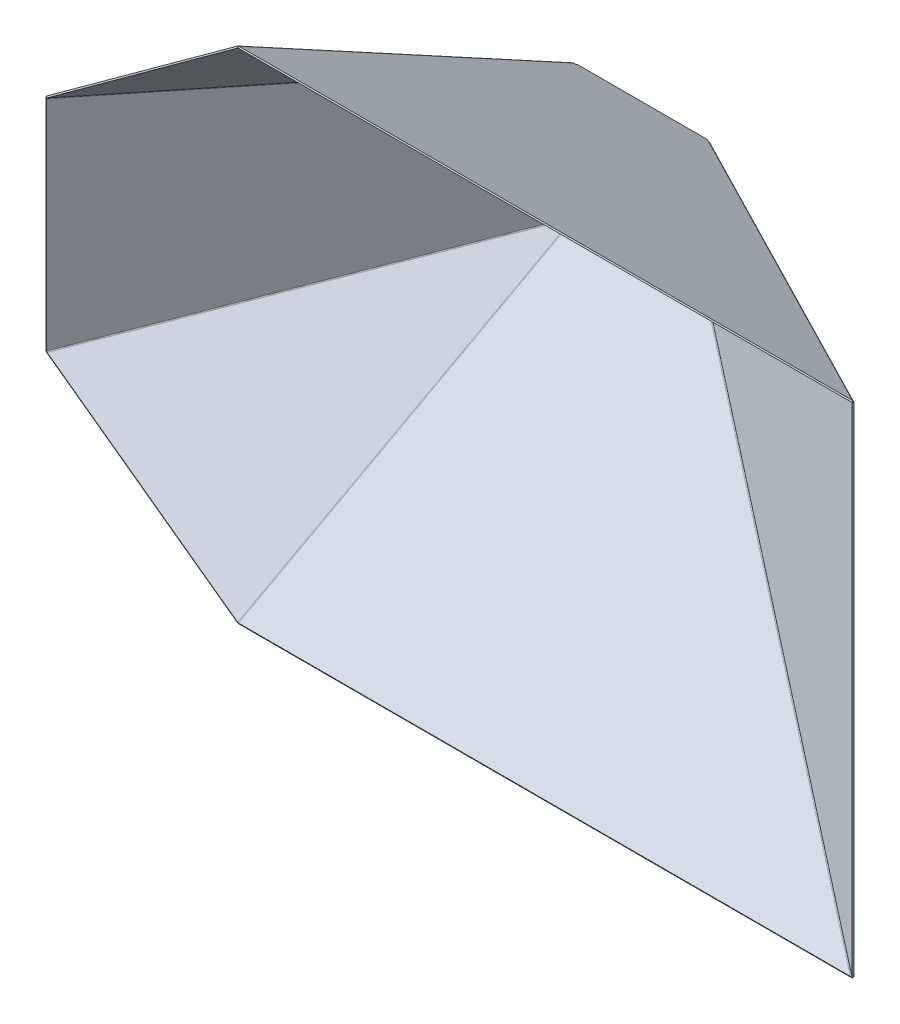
ISO-10303-21;
HEADER;
FILE_DESCRIPTION(('STEP AP214'),'2;1');
FILE_NAME('part.step','',(''),(''),'','','');
FILE_SCHEMA(('AUTOMOTIVE_DESIGN { 1 0 10303 214 1 1 1 1 }'));
ENDSEC;
DATA;
#1=APPLICATION_CONTEXT('core data for automotive mechanical design processes');
#2=APPLICATION_PROTOCOL_DEFINITION('international standard','automotive_design',2000,#1);
#3=PRODUCT_CONTEXT('',#1,'mechanical');
#4=PRODUCT('Part','Part','',(#3));
#5=PRODUCT_RELATED_PRODUCT_CATEGORY('part','',(#4));
#6=PRODUCT_DEFINITION_FORMATION('','',#4);
#7=PRODUCT_DEFINITION_CONTEXT('part definition',#1,'design');
#8=PRODUCT_DEFINITION('design','',#6,#7);
#9=PRODUCT_DEFINITION_SHAPE('','',#8);
#10=(LENGTH_UNIT() NAMED_UNIT(*) SI_UNIT(.MILLI.,.METRE.));
#11=(NAMED_UNIT(*) PLANE_ANGLE_UNIT() SI_UNIT($,.RADIAN.));
#12=(NAMED_UNIT(*) SI_UNIT($,.STERADIAN.) SOLID_ANGLE_UNIT());
#13=UNCERTAINTY_MEASURE_WITH_UNIT(LENGTH_MEASURE(1.E-05),#10,'distance_accuracy_value','');
#14=(GEOMETRIC_REPRESENTATION_CONTEXT(3) GLOBAL_UNCERTAINTY_ASSIGNED_CONTEXT((#13)) GLOBAL_UNIT_ASSIGNED_CONTEXT((#10,
#11,#12)) REPRESENTATION_CONTEXT('',''));
#15=CARTESIAN_POINT('',(0.,0.,0.));
#16=DIRECTION('',(0.,0.,1.));
#17=DIRECTION('',(1.,0.,0.));
#18=AXIS2_PLACEMENT_3D('',#15,#16,#17);
#19=CARTESIAN_POINT('',(-19.4165217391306,-945.24214678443,538.793635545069));
#20=DIRECTION('',(0.,-0.477513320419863,-0.878624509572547));
#21=DIRECTION('',(0.,0.878624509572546,-0.477513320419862));
#22=AXIS2_PLACEMENT_3D('',#19,#20,#21);
#23=PLANE('',#22);
#24=DIRECTION('',(0.,0.878624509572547,-0.477513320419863));
#25=VECTOR('',#24,1.);
#26=CARTESIAN_POINT('',(-43.4148961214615,-945.24214678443,538.793635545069));
#27=LINE('',#26,#25);
#28=CARTESIAN_POINT('',(-43.4148961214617,45.2595181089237,0.47751332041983));
#29=VERTEX_POINT('',#28);
#30=CARTESIAN_POINT('',(-43.4148961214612,46.1381426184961,0.));
#31=VERTEX_POINT('',#30);
#32=EDGE_CURVE('E429',#29,#31,#27,.T.);
#33=ORIENTED_EDGE('',*,*,#32,.T.);
#34=DIRECTION('',(-1.,0.,0.));
#35=VECTOR('',#34,1.);
#36=CARTESIAN_POINT('',(-19.4165217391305,46.1381426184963,0.));
#37=LINE('',#36,#35);
#38=CARTESIAN_POINT('',(45.6739178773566,46.1381426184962,0.));
#39=VERTEX_POINT('',#38);
#40=EDGE_CURVE('E134',#39,#31,#37,.T.);
#41=ORIENTED_EDGE('',*,*,#40,.F.);
#42=DIRECTION('',(0.,0.878624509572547,-0.477513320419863));
#43=VECTOR('',#42,1.);
#44=CARTESIAN_POINT('',(45.6739178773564,-945.24214678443,538.793635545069));
#45=LINE('',#44,#43);
#46=CARTESIAN_POINT('',(45.6739178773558,45.2595181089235,0.477513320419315));
#47=VERTEX_POINT('',#46);
#48=EDGE_CURVE('E1399',#47,#39,#45,.T.);
#49=ORIENTED_EDGE('',*,*,#48,.F.);
#50=DIRECTION('',(1.,0.,0.));
#51=VECTOR('',#50,1.);
#52=CARTESIAN_POINT('',(-19.4165217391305,45.2595181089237,0.477513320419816));
#53=LINE('',#52,#51);
#54=EDGE_CURVE('E13',#29,#47,#53,.T.);
#55=ORIENTED_EDGE('',*,*,#54,.F.);
#56=EDGE_LOOP('',(#33,#41,#49,#55));
#57=FACE_BOUND('',#56,.T.);
#58=ADVANCED_FACE('F77',(#57),#23,.T.);
#59=CARTESIAN_POINT('',(-19.4202523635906,-969.955946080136,493.320244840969));
#60=DIRECTION('',(0.622344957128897,-0.373770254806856,-0.687737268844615));
#61=DIRECTION('',(0.660605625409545,-0.220489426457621,0.717624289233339));
#62=AXIS2_PLACEMENT_3D('',#59,#60,#61);
#63=PLANE('',#62);
#64=ORIENTED_EDGE('',*,*,#48,.T.);
#65=DIRECTION('',(0.782743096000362,0.297178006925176,0.546807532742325));
#66=VECTOR('',#65,1.);
#67=CARTESIAN_POINT('',(-121.189216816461,-17.2134909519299,-116.567005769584));
#68=LINE('',#67,#66);
#69=CARTESIAN_POINT('',(374.2303679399,170.878624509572,229.52248667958));
#70=VERTEX_POINT('',#69);
#71=EDGE_CURVE('E1394',#39,#70,#68,.T.);
#72=ORIENTED_EDGE('',*,*,#71,.T.);
#73=DIRECTION('',(0.,0.878624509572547,-0.477513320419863));
#74=VECTOR('',#73,1.);
#75=CARTESIAN_POINT('',(374.2303679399,-820.501664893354,768.316122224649));
#76=LINE('',#75,#74);
#77=CARTESIAN_POINT('',(374.2303679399,170.,230.));
#78=VERTEX_POINT('',#77);
#79=EDGE_CURVE('E1379',#78,#70,#76,.T.);
#80=ORIENTED_EDGE('',*,*,#79,.F.);
#81=DIRECTION('',(-0.782743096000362,-0.297178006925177,-0.546807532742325));
#82=VECTOR('',#81,1.);
#83=CARTESIAN_POINT('',(-19.4202523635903,20.5457188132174,-44.9958773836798));
#84=LINE('',#83,#82);
#85=EDGE_CURVE('E95',#78,#47,#84,.T.);
#86=ORIENTED_EDGE('',*,*,#85,.T.);
#87=EDGE_LOOP('',(#64,#72,#80,#86));
#88=FACE_BOUND('',#87,.T.);
#89=ADVANCED_FACE('F1427',(#88),#63,.T.);
#90=CARTESIAN_POINT('',(-43.4141610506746,-969.958349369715,493.315822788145));
#91=DIRECTION('',(0.999999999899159,6.78138496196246E-06,1.24777483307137E-05));
#92=DIRECTION('',(-1.20564607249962E-05,-0.0589267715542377,0.998262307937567));
#93=AXIS2_PLACEMENT_3D('',#90,#91,#92);
#94=PLANE('',#93);
#95=DIRECTION('',(1.42014571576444E-05,-0.47751332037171,-0.878624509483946));
#96=VECTOR('',#95,1.);
#97=CARTESIAN_POINT('',(-43.4141610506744,21.4219400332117,-45.4778127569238));
#98=LINE('',#97,#96);
#99=CARTESIAN_POINT('',(-43.4149121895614,46.6784204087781,0.994111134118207));
#100=VERTEX_POINT('',#99);
#101=EDGE_CURVE('E127',#100,#31,#98,.T.);
#102=ORIENTED_EDGE('',*,*,#101,.T.);
#103=ORIENTED_EDGE('',*,*,#32,.F.);
#104=DIRECTION('',(-1.42014571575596E-05,0.47751332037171,0.878624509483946));
#105=VECTOR('',#104,1.);
#106=CARTESIAN_POINT('',(-43.4141610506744,20.5433155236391,-45.000299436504));
#107=LINE('',#106,#105);
#108=CARTESIAN_POINT('',(-43.4149121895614,45.7997958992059,1.47162445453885));
#109=VERTEX_POINT('',#108);
#110=EDGE_CURVE('E1389',#29,#109,#107,.T.);
#111=ORIENTED_EDGE('',*,*,#110,.T.);
#112=DIRECTION('',(0.,0.878624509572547,-0.477513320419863));
#113=VECTOR('',#112,1.);
#114=CARTESIAN_POINT('',(-43.4149121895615,-944.701868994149,539.787746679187));
#115=LINE('',#114,#113);
#116=EDGE_CURVE('E418',#109,#100,#115,.T.);
#117=ORIENTED_EDGE('',*,*,#116,.T.);
#118=EDGE_LOOP('',(#102,#103,#111,#117));
#119=FACE_BOUND('',#118,.T.);
#120=ADVANCED_FACE('F1431',(#119),#94,.F.);
#121=CARTESIAN_POINT('',(-19.4172728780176,-944.701706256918,539.788046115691));
#122=DIRECTION('',(-1.42014571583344E-05,0.47751332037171,0.878624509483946));
#123=DIRECTION('',(0.,-0.878624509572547,0.477513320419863));
#124=AXIS2_PLACEMENT_3D('',#121,#122,#123);
#125=PLANE('',#124);
#126=DIRECTION('',(0.99999999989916,6.7813849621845E-06,1.24777483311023E-05));
#127=VECTOR('',#126,1.);
#128=CARTESIAN_POINT('',(-19.4172728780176,46.6785831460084,0.994410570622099));
#129=LINE('',#128,#127);
#130=CARTESIAN_POINT('',(-44.7080548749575,46.6784116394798,0.994094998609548));
#131=VERTEX_POINT('',#130);
#132=EDGE_CURVE('E403',#131,#100,#129,.T.);
#133=ORIENTED_EDGE('',*,*,#132,.T.);
#134=ORIENTED_EDGE('',*,*,#116,.F.);
#135=DIRECTION('',(-0.99999999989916,-6.7813849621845E-06,-1.24777483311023E-05));
#136=VECTOR('',#135,1.);
#137=CARTESIAN_POINT('',(-19.4172728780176,45.7999586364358,1.47192389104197));
#138=LINE('',#137,#136);
#139=CARTESIAN_POINT('',(-44.7080548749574,45.799787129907,1.47160831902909));
#140=VERTEX_POINT('',#139);
#141=EDGE_CURVE('E404',#109,#140,#138,.T.);
#142=ORIENTED_EDGE('',*,*,#141,.T.);
#143=DIRECTION('',(0.,0.878624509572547,-0.477513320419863));
#144=VECTOR('',#143,1.);
#145=CARTESIAN_POINT('',(-44.7080548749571,-944.701877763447,539.787730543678));
#146=LINE('',#145,#144);
#147=EDGE_CURVE('E399',#140,#131,#146,.T.);
#148=ORIENTED_EDGE('',*,*,#147,.T.);
#149=EDGE_LOOP('',(#133,#134,#142,#148));
#150=FACE_BOUND('',#149,.T.);
#151=ADVANCED_FACE('F401',(#150),#125,.F.);
#152=CARTESIAN_POINT('',(-19.4165217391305,21.422102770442,-45.4775133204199));
#153=DIRECTION('',(0.,0.878624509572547,-0.477513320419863));
#154=DIRECTION('',(0.,0.477513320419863,0.878624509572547));
#155=AXIS2_PLACEMENT_3D('',#152,#153,#154);
#156=PLANE('',#155);
#157=DIRECTION('',(1.42014571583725E-05,-0.47751332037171,-0.878624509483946));
#158=VECTOR('',#157,1.);
#159=CARTESIAN_POINT('',(-44.708054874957,46.6784116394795,0.994094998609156));
#160=LINE('',#159,#158);
#161=CARTESIAN_POINT('',(-44.7117486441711,170.878624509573,229.52248667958));
#162=VERTEX_POINT('',#161);
#163=EDGE_CURVE('E416',#162,#131,#160,.T.);
#164=ORIENTED_EDGE('',*,*,#163,.F.);
#165=DIRECTION('',(1.,0.,0.));
#166=VECTOR('',#165,1.);
#167=CARTESIAN_POINT('',(-19.4165217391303,170.878624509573,229.52248667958));
#168=LINE('',#167,#166);
#169=EDGE_CURVE('E409',#162,#70,#168,.T.);
#170=ORIENTED_EDGE('',*,*,#169,.T.);
#171=ORIENTED_EDGE('',*,*,#71,.F.);
#172=ORIENTED_EDGE('',*,*,#40,.T.);
#173=ORIENTED_EDGE('',*,*,#101,.F.);
#174=ORIENTED_EDGE('',*,*,#132,.F.);
#175=EDGE_LOOP('',(#164,#170,#171,#172,#173,#174));
#176=FACE_BOUND('',#175,.T.);
#177=ADVANCED_FACE('F414',(#176),#156,.T.);
#178=CARTESIAN_POINT('',(-19.4165217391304,-820.501664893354,768.31612222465));
#179=DIRECTION('',(0.,-0.477513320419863,-0.878624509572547));
#180=DIRECTION('',(0.,0.878624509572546,-0.477513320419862));
#181=AXIS2_PLACEMENT_3D('',#178,#179,#180);
#182=PLANE('',#181);
#183=ORIENTED_EDGE('',*,*,#169,.F.);
#184=DIRECTION('',(0.,0.878624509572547,-0.477513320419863));
#185=VECTOR('',#184,1.);
#186=CARTESIAN_POINT('',(-44.7117486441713,-820.501664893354,768.316122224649));
#187=LINE('',#186,#185);
#188=CARTESIAN_POINT('',(-44.7117486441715,170.,230.));
#189=VERTEX_POINT('',#188);
#190=EDGE_CURVE('E430',#189,#162,#187,.T.);
#191=ORIENTED_EDGE('',*,*,#190,.F.);
#192=DIRECTION('',(-1.,0.,0.));
#193=VECTOR('',#192,1.);
#194=CARTESIAN_POINT('',(-175.76,170.,230.));
#195=LINE('',#194,#193);
#196=EDGE_CURVE('E1375',#78,#189,#195,.T.);
#197=ORIENTED_EDGE('',*,*,#196,.F.);
#198=ORIENTED_EDGE('',*,*,#79,.T.);
#199=EDGE_LOOP('',(#183,#191,#197,#198));
#200=FACE_BOUND('',#199,.T.);
#201=ADVANCED_FACE('F1440',(#200),#182,.F.);
#202=CARTESIAN_POINT('',(-19.4165217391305,20.5434782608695,-45.0000000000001));
#203=DIRECTION('',(0.,0.878624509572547,-0.477513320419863));
#204=DIRECTION('',(0.,0.477513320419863,0.878624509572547));
#205=AXIS2_PLACEMENT_3D('',#202,#203,#204);
#206=PLANE('',#205);
#207=ORIENTED_EDGE('',*,*,#196,.T.);
#208=DIRECTION('',(1.42014571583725E-05,-0.47751332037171,-0.878624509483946));
#209=VECTOR('',#208,1.);
#210=CARTESIAN_POINT('',(-44.708054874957,45.799787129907,1.47160831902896));
#211=LINE('',#210,#209);
#212=EDGE_CURVE('E87',#189,#140,#211,.T.);
#213=ORIENTED_EDGE('',*,*,#212,.T.);
#214=ORIENTED_EDGE('',*,*,#141,.F.);
#215=ORIENTED_EDGE('',*,*,#110,.F.);
#216=ORIENTED_EDGE('',*,*,#54,.T.);
#217=ORIENTED_EDGE('',*,*,#85,.F.);
#218=EDGE_LOOP('',(#207,#213,#214,#215,#216,#217));
#219=FACE_BOUND('',#218,.T.);
#220=ADVANCED_FACE('F79',(#219),#206,.F.);
#221=CARTESIAN_POINT('',(310.362592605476,-443.314895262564,267.300544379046));
#222=DIRECTION('',(1.42014571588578E-05,-0.47751332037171,-0.878624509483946));
#223=DIRECTION('',(-0.538069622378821,0.740589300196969,-0.402502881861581));
#224=AXIS2_PLACEMENT_3D('',#221,#222,#223);
#225=PLANE('',#224);
#226=DIRECTION('',(-0.842900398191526,-0.472766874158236,0.256924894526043));
#227=VECTOR('',#226,1.);
#228=CARTESIAN_POINT('',(-45.5380934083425,46.5403744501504,1.06910179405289));
#229=LINE('',#228,#227);
#230=CARTESIAN_POINT('',(-45.7841941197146,46.4023412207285,1.14411587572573));
#231=VERTEX_POINT('',#230);
#232=CARTESIAN_POINT('',(-45.9196435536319,46.3263701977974,1.18540228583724));
#233=VERTEX_POINT('',#232);
#234=EDGE_CURVE('E161',#231,#233,#229,.T.);
#235=ORIENTED_EDGE('',*,*,#234,.F.);
#236=DIRECTION('',(-0.53806962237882,0.740589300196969,-0.402502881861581));
#237=VECTOR('',#236,1.);
#238=CARTESIAN_POINT('',(310.116491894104,-443.452928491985,267.375558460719));
#239=LINE('',#238,#237);
#240=CARTESIAN_POINT('',(-45.2461244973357,45.6617519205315,1.54661875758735));
#241=VERTEX_POINT('',#240);
#242=EDGE_CURVE('E434',#241,#231,#239,.T.);
#243=ORIENTED_EDGE('',*,*,#242,.F.);
#244=DIRECTION('',(-0.842900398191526,-0.472766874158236,0.256924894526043));
#245=VECTOR('',#244,1.);
#246=CARTESIAN_POINT('',(-45.0000237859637,45.7997851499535,1.47160467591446));
#247=LINE('',#246,#245);
#248=CARTESIAN_POINT('',(-45.3815739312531,45.5857808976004,1.58790516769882));
#249=VERTEX_POINT('',#248);
#250=EDGE_CURVE('E1320',#241,#249,#247,.T.);
#251=ORIENTED_EDGE('',*,*,#250,.T.);
#252=DIRECTION('',(-0.53806962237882,0.740589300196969,-0.402502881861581));
#253=VECTOR('',#252,1.);
#254=CARTESIAN_POINT('',(309.981042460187,-443.528899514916,267.41684487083));
#255=LINE('',#254,#253);
#256=EDGE_CURVE('E1318',#249,#233,#255,.T.);
#257=ORIENTED_EDGE('',*,*,#256,.T.);
#258=EDGE_LOOP('',(#235,#243,#251,#257));
#259=FACE_BOUND('',#258,.T.);
#260=ADVANCED_FACE('F1419',(#259),#225,.T.);
#261=CARTESIAN_POINT('',(414.043362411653,-342.902795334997,313.453391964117));
#262=DIRECTION('',(0.491085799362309,-0.112668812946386,-0.863794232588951));
#263=DIRECTION('',(0.865794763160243,0.172515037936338,0.469721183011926));
#264=AXIS2_PLACEMENT_3D('',#261,#262,#263);
#265=PLANE('',#264);
#266=DIRECTION('',(-0.685066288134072,-0.662444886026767,-0.30306922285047));
#267=VECTOR('',#266,1.);
#268=CARTESIAN_POINT('',(58.142676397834,146.952474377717,47.2219493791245));
#269=LINE('',#268,#267);
#270=CARTESIAN_POINT('',(-46.0297299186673,46.2199189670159,1.13670073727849));
#271=VERTEX_POINT('',#270);
#272=EDGE_CURVE('E1309',#233,#271,#269,.T.);
#273=ORIENTED_EDGE('',*,*,#272,.F.);
#274=ORIENTED_EDGE('',*,*,#256,.F.);
#275=DIRECTION('',(-0.685066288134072,-0.662444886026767,-0.30306922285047));
#276=VECTOR('',#275,1.);
#277=CARTESIAN_POINT('',(58.6807460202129,146.21188507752,47.6244522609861));
#278=LINE('',#277,#276);
#279=CARTESIAN_POINT('',(-45.4916602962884,45.4793296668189,1.53920361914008));
#280=VERTEX_POINT('',#279);
#281=EDGE_CURVE('E143',#249,#280,#278,.T.);
#282=ORIENTED_EDGE('',*,*,#281,.T.);
#283=DIRECTION('',(-0.53806962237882,0.740589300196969,-0.402502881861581));
#284=VECTOR('',#283,1.);
#285=CARTESIAN_POINT('',(309.870956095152,-443.635350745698,267.368143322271));
#286=LINE('',#285,#284);
#287=EDGE_CURVE('E1314',#280,#271,#286,.T.);
#288=ORIENTED_EDGE('',*,*,#287,.T.);
#289=EDGE_LOOP('',(#273,#274,#282,#288));
#290=FACE_BOUND('',#289,.T.);
#291=ADVANCED_FACE('F1417',(#290),#265,.T.);
#292=CARTESIAN_POINT('',(-45.5417871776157,170.740589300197,229.597497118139));
#293=DIRECTION('',(0.538069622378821,-0.740589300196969,0.402502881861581));
#294=DIRECTION('',(-0.809016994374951,-0.587785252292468,0.));
#295=AXIS2_PLACEMENT_3D('',#292,#293,#294);
#296=PLANE('',#295);
#297=DIRECTION('',(-1.42014571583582E-05,0.47751332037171,0.878624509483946));
#298=VECTOR('',#297,1.);
#299=CARTESIAN_POINT('',(-45.7841941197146,46.4023412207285,1.14411587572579));
#300=LINE('',#299,#298);
#301=CARTESIAN_POINT('',(-45.7878866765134,170.561787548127,229.597497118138));
#302=VERTEX_POINT('',#301);
#303=EDGE_CURVE('E1322',#231,#302,#300,.T.);
#304=ORIENTED_EDGE('',*,*,#303,.F.);
#305=ORIENTED_EDGE('',*,*,#234,.T.);
#306=ORIENTED_EDGE('',*,*,#272,.T.);
#307=DIRECTION('',(-0.491085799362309,0.112668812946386,0.863794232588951));
#308=VECTOR('',#307,1.);
#309=CARTESIAN_POINT('',(-46.0297299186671,46.2199189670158,1.13670073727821));
#310=LINE('',#309,#308);
#311=CARTESIAN_POINT('',(-175.914659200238,76.019153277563,229.597497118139));
#312=VERTEX_POINT('',#311);
#313=EDGE_CURVE('E1312',#271,#312,#310,.T.);
#314=ORIENTED_EDGE('',*,*,#313,.T.);
#315=DIRECTION('',(0.809016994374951,0.587785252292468,0.));
#316=VECTOR('',#315,1.);
#317=CARTESIAN_POINT('',(-176.298069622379,75.7405893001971,229.597497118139));
#318=LINE('',#317,#316);
#319=EDGE_CURVE('E1306',#312,#302,#318,.T.);
#320=ORIENTED_EDGE('',*,*,#319,.T.);
#321=EDGE_LOOP('',(#304,#305,#306,#314,#320));
#322=FACE_BOUND('',#321,.T.);
#323=ADVANCED_FACE('F1359',(#322),#296,.F.);
#324=CARTESIAN_POINT('',(179.60261639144,-414.114680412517,495.828939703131));
#325=DIRECTION('',(-0.236585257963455,0.325631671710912,0.915418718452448));
#326=DIRECTION('',(-0.962080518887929,-0.210150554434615,-0.173890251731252));
#327=AXIS2_PLACEMENT_3D('',#324,#325,#326);
#328=PLANE('',#327);
#329=ORIENTED_EDGE('',*,*,#319,.F.);
#330=DIRECTION('',(-0.53806962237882,0.740589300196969,-0.402502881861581));
#331=VECTOR('',#330,1.);
#332=CARTESIAN_POINT('',(179.986026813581,-413.836116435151,495.828939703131));
#333=LINE('',#332,#331);
#334=CARTESIAN_POINT('',(-175.376589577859,75.278563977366,230.));
#335=VERTEX_POINT('',#334);
#336=EDGE_CURVE('E1324',#335,#312,#333,.T.);
#337=ORIENTED_EDGE('',*,*,#336,.F.);
#338=DIRECTION('',(0.809016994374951,0.587785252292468,0.));
#339=VECTOR('',#338,1.);
#340=CARTESIAN_POINT('',(-175.76,75.0000000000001,230.));
#341=LINE('',#340,#339);
#342=CARTESIAN_POINT('',(-45.2498170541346,169.82119824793,230.));
#343=VERTEX_POINT('',#342);
#344=EDGE_CURVE('E1298',#335,#343,#341,.T.);
#345=ORIENTED_EDGE('',*,*,#344,.T.);
#346=DIRECTION('',(-0.53806962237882,0.740589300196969,-0.402502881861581));
#347=VECTOR('',#346,1.);
#348=CARTESIAN_POINT('',(310.112799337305,-319.293482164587,495.828939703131));
#349=LINE('',#348,#347);
#350=EDGE_CURVE('E537',#343,#302,#349,.T.);
#351=ORIENTED_EDGE('',*,*,#350,.T.);
#352=EDGE_LOOP('',(#329,#337,#345,#351));
#353=FACE_BOUND('',#352,.T.);
#354=ADVANCED_FACE('F1348',(#353),#328,.T.);
#355=CARTESIAN_POINT('',(-45.0037175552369,170.,230.));
#356=DIRECTION('',(0.538069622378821,-0.740589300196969,0.402502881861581));
#357=DIRECTION('',(-0.809016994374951,-0.587785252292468,0.));
#358=AXIS2_PLACEMENT_3D('',#355,#356,#357);
#359=PLANE('',#358);
#360=ORIENTED_EDGE('',*,*,#250,.F.);
#361=DIRECTION('',(-1.42014571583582E-05,0.47751332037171,0.878624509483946));
#362=VECTOR('',#361,1.);
#363=CARTESIAN_POINT('',(-45.2461244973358,45.6617519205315,1.54661875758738));
#364=LINE('',#363,#362);
#365=EDGE_CURVE('E1401',#241,#343,#364,.T.);
#366=ORIENTED_EDGE('',*,*,#365,.T.);
#367=ORIENTED_EDGE('',*,*,#344,.F.);
#368=DIRECTION('',(-0.491085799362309,0.112668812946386,0.863794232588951));
#369=VECTOR('',#368,1.);
#370=CARTESIAN_POINT('',(-45.4916602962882,45.4793296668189,1.53920361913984));
#371=LINE('',#370,#369);
#372=EDGE_CURVE('E1185',#280,#335,#371,.T.);
#373=ORIENTED_EDGE('',*,*,#372,.F.);
#374=ORIENTED_EDGE('',*,*,#281,.F.);
#375=EDGE_LOOP('',(#360,#366,#367,#373,#374));
#376=FACE_BOUND('',#375,.T.);
#377=ADVANCED_FACE('F1358',(#376),#359,.T.);
#378=CARTESIAN_POINT('',(571.215390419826,-44.0978807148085,350.44951317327));
#379=DIRECTION('',(0.0556846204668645,-0.993632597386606,-0.0979463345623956));
#380=DIRECTION('',(-0.869329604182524,0.,-0.49423277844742));
#381=AXIS2_PLACEMENT_3D('',#378,#379,#380);
#382=PLANE('',#381);
#383=DIRECTION('',(-0.491085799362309,-0.112668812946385,0.863794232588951));
#384=VECTOR('',#383,1.);
#385=CARTESIAN_POINT('',(-45.9198856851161,-44.0978807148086,-0.40530727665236));
#386=LINE('',#385,#384);
#387=CARTESIAN_POINT('',(-46.1503116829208,-44.1507468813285,0.));
#388=VERTEX_POINT('',#387);
#389=CARTESIAN_POINT('',(-46.7179040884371,-44.2809684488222,0.998365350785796));
#390=VERTEX_POINT('',#389);
#391=EDGE_CURVE('E226',#388,#390,#386,.T.);
#392=ORIENTED_EDGE('',*,*,#391,.F.);
#393=DIRECTION('',(-0.869329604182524,0.,-0.49423277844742));
#394=VECTOR('',#393,1.);
#395=CARTESIAN_POINT('',(570.984964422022,-44.1507468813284,350.854820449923));
#396=LINE('',#395,#394);
#397=CARTESIAN_POINT('',(-45.2809820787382,-44.1507468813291,0.494232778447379));
#398=VERTEX_POINT('',#397);
#399=EDGE_CURVE('E1241',#398,#388,#396,.T.);
#400=ORIENTED_EDGE('',*,*,#399,.F.);
#401=DIRECTION('',(-0.491085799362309,-0.112668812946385,0.863794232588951));
#402=VECTOR('',#401,1.);
#403=CARTESIAN_POINT('',(-45.0505560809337,-44.0978807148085,0.0889255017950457));
#404=LINE('',#403,#402);
#405=CARTESIAN_POINT('',(-45.8485744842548,-44.2809684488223,1.49259812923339));
#406=VERTEX_POINT('',#405);
#407=EDGE_CURVE('E1248',#398,#406,#404,.T.);
#408=ORIENTED_EDGE('',*,*,#407,.T.);
#409=DIRECTION('',(-0.869329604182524,0.,-0.49423277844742));
#410=VECTOR('',#409,1.);
#411=CARTESIAN_POINT('',(570.417372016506,-44.2809684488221,351.853185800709));
#412=LINE('',#411,#410);
#413=EDGE_CURVE('E1246',#406,#390,#412,.T.);
#414=ORIENTED_EDGE('',*,*,#413,.T.);
#415=EDGE_LOOP('',(#392,#400,#408,#414));
#416=FACE_BOUND('',#415,.T.);
#417=ADVANCED_FACE('F1421',(#416),#382,.T.);
#418=CARTESIAN_POINT('',(570.984964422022,-45.0000000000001,350.854820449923));
#419=DIRECTION('',(0.49423277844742,0.,-0.869329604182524));
#420=DIRECTION('',(0.475102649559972,0.837448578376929,0.270106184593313));
#421=AXIS2_PLACEMENT_3D('',#418,#419,#420);
#422=PLANE('',#421);
#423=DIRECTION('',(0.,-1.,0.));
#424=VECTOR('',#423,1.);
#425=CARTESIAN_POINT('',(-46.1503116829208,-45.,0.));
#426=LINE('',#425,#424);
#427=CARTESIAN_POINT('',(-46.1503116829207,44.1507468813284,0.));
#428=VERTEX_POINT('',#427);
#429=EDGE_CURVE('E1202',#428,#388,#426,.T.);
#430=ORIENTED_EDGE('',*,*,#429,.F.);
#431=DIRECTION('',(-0.869329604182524,0.,-0.49423277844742));
#432=VECTOR('',#431,1.);
#433=CARTESIAN_POINT('',(570.984964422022,44.1507468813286,350.854820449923));
#434=LINE('',#433,#432);
#435=CARTESIAN_POINT('',(-45.2809820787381,44.1507468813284,0.494232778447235));
#436=VERTEX_POINT('',#435);
#437=EDGE_CURVE('E1235',#436,#428,#434,.T.);
#438=ORIENTED_EDGE('',*,*,#437,.F.);
#439=DIRECTION('',(0.,-1.,0.));
#440=VECTOR('',#439,1.);
#441=CARTESIAN_POINT('',(-45.2809820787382,-45.0000000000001,0.494232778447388));
#442=LINE('',#441,#440);
#443=EDGE_CURVE('E1243',#436,#398,#442,.T.);
#444=ORIENTED_EDGE('',*,*,#443,.T.);
#445=ORIENTED_EDGE('',*,*,#399,.T.);
#446=EDGE_LOOP('',(#430,#438,#444,#445));
#447=FACE_BOUND('',#446,.T.);
#448=ADVANCED_FACE('F1425',(#447),#422,.T.);
#449=CARTESIAN_POINT('',(576.195095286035,42.9553971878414,341.690472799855));
#450=DIRECTION('',(0.0556846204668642,0.993632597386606,-0.097946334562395));
#451=DIRECTION('',(0.869329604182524,0.,0.49423277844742));
#452=AXIS2_PLACEMENT_3D('',#449,#450,#451);
#453=PLANE('',#452);
#454=DIRECTION('',(0.491085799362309,-0.112668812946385,-0.863794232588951));
#455=VECTOR('',#454,1.);
#456=CARTESIAN_POINT('',(-40.9401808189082,42.9553971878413,-9.16434765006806));
#457=LINE('',#456,#455);
#458=CARTESIAN_POINT('',(-46.7179040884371,44.2809684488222,0.998365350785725));
#459=VERTEX_POINT('',#458);
#460=EDGE_CURVE('E1205',#459,#428,#457,.T.);
#461=ORIENTED_EDGE('',*,*,#460,.F.);
#462=DIRECTION('',(-0.869329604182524,0.,-0.49423277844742));
#463=VECTOR('',#462,1.);
#464=CARTESIAN_POINT('',(570.417372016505,44.2809684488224,351.853185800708));
#465=LINE('',#464,#463);
#466=CARTESIAN_POINT('',(-45.8485744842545,44.2809684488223,1.49259812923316));
#467=VERTEX_POINT('',#466);
#468=EDGE_CURVE('E1232',#467,#459,#465,.T.);
#469=ORIENTED_EDGE('',*,*,#468,.F.);
#470=DIRECTION('',(0.491085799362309,-0.112668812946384,-0.863794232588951));
#471=VECTOR('',#470,1.);
#472=CARTESIAN_POINT('',(-40.0708512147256,42.9553971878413,-8.67011487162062));
#473=LINE('',#472,#471);
#474=EDGE_CURVE('E1238',#467,#436,#473,.T.);
#475=ORIENTED_EDGE('',*,*,#474,.T.);
#476=ORIENTED_EDGE('',*,*,#437,.T.);
#477=EDGE_LOOP('',(#461,#469,#475,#476));
#478=FACE_BOUND('',#477,.T.);
#479=ADVANCED_FACE('F1782',(#478),#453,.T.);
#480=CARTESIAN_POINT('',(565.488223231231,-43.6744287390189,360.523300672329));
#481=DIRECTION('',(0.491085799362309,-0.112668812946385,-0.863794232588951));
#482=DIRECTION('',(0.505594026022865,0.844355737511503,0.177307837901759));
#483=AXIS2_PLACEMENT_3D('',#480,#481,#482);
#484=PLANE('',#483);
#485=DIRECTION('',(-0.0556846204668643,-0.993632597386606,0.0979463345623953));
#486=VECTOR('',#485,1.);
#487=CARTESIAN_POINT('',(-51.6470528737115,-43.6744287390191,9.66848022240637));
#488=LINE('',#487,#486);
#489=CARTESIAN_POINT('',(-46.7011980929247,44.5790691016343,0.968980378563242));
#490=VERTEX_POINT('',#489);
#491=EDGE_CURVE('E1208',#490,#459,#488,.T.);
#492=ORIENTED_EDGE('',*,*,#491,.F.);
#493=DIRECTION('',(-0.869329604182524,0.,-0.49423277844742));
#494=VECTOR('',#493,1.);
#495=CARTESIAN_POINT('',(570.434078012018,44.5790691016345,351.823800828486));
#496=LINE('',#495,#494);
#497=CARTESIAN_POINT('',(-45.8318684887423,44.5790691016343,1.46321315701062));
#498=VERTEX_POINT('',#497);
#499=EDGE_CURVE('E1227',#498,#490,#496,.T.);
#500=ORIENTED_EDGE('',*,*,#499,.F.);
#501=DIRECTION('',(-0.0556846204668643,-0.993632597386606,0.0979463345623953));
#502=VECTOR('',#501,1.);
#503=CARTESIAN_POINT('',(-50.777723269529,-43.6744287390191,10.1627130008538));
#504=LINE('',#503,#502);
#505=EDGE_CURVE('E179',#498,#467,#504,.T.);
#506=ORIENTED_EDGE('',*,*,#505,.T.);
#507=ORIENTED_EDGE('',*,*,#468,.T.);
#508=EDGE_LOOP('',(#492,#500,#506,#507));
#509=FACE_BOUND('',#508,.T.);
#510=ADVANCED_FACE('F1773',(#509),#484,.T.);
#511=CARTESIAN_POINT('',(565.488223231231,-43.6744287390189,360.523300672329));
#512=DIRECTION('',(0.491085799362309,-0.112668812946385,-0.863794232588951));
#513=DIRECTION('',(0.505594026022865,0.844355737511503,0.177307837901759));
#514=AXIS2_PLACEMENT_3D('',#511,#512,#513);
#515=PLANE('',#514);
#516=DIRECTION('',(-0.0556846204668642,-0.993632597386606,0.0979463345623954));
#517=VECTOR('',#516,1.);
#518=CARTESIAN_POINT('',(-51.6470528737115,-43.6744287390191,9.66848022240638));
#519=LINE('',#518,#517);
#520=CARTESIAN_POINT('',(-46.6922498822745,44.7387403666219,0.953240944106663));
#521=VERTEX_POINT('',#520);
#522=EDGE_CURVE('E1211',#521,#490,#519,.T.);
#523=ORIENTED_EDGE('',*,*,#522,.F.);
#524=DIRECTION('',(-0.869329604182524,0.,-0.49423277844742));
#525=VECTOR('',#524,1.);
#526=CARTESIAN_POINT('',(570.443026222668,44.7387403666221,351.808061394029));
#527=LINE('',#526,#525);
#528=CARTESIAN_POINT('',(-45.8229202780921,44.7387403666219,1.44747372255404));
#529=VERTEX_POINT('',#528);
#530=EDGE_CURVE('E1251',#529,#521,#527,.T.);
#531=ORIENTED_EDGE('',*,*,#530,.F.);
#532=DIRECTION('',(-0.0556846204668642,-0.993632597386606,0.0979463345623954));
#533=VECTOR('',#532,1.);
#534=CARTESIAN_POINT('',(-50.7777232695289,-43.6744287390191,10.1627130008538));
#535=LINE('',#534,#533);
#536=EDGE_CURVE('E1230',#529,#498,#535,.T.);
#537=ORIENTED_EDGE('',*,*,#536,.T.);
#538=ORIENTED_EDGE('',*,*,#499,.T.);
#539=EDGE_LOOP('',(#523,#531,#537,#538));
#540=FACE_BOUND('',#539,.T.);
#541=ADVANCED_FACE('F1764',(#540),#515,.T.);
#542=CARTESIAN_POINT('',(570.467928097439,-45.1830877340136,351.764260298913));
#543=DIRECTION('',(0.491085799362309,0.112668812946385,-0.863794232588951));
#544=DIRECTION('',(0.440998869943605,0.822988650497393,0.358063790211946));
#545=AXIS2_PLACEMENT_3D('',#542,#543,#544);
#546=PLANE('',#545);
#547=DIRECTION('',(0.0556846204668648,-0.993632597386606,-0.097946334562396));
#548=VECTOR('',#547,1.);
#549=CARTESIAN_POINT('',(-46.6673480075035,-45.1830877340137,0.9094398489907));
#550=LINE('',#549,#548);
#551=CARTESIAN_POINT('',(-46.7011980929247,-44.5790691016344,0.968980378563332));
#552=VERTEX_POINT('',#551);
#553=EDGE_CURVE('E1197',#390,#552,#550,.T.);
#554=ORIENTED_EDGE('',*,*,#553,.F.);
#555=ORIENTED_EDGE('',*,*,#413,.F.);
#556=DIRECTION('',(0.0556846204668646,-0.993632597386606,-0.0979463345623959));
#557=VECTOR('',#556,1.);
#558=CARTESIAN_POINT('',(-45.7980184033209,-45.1830877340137,1.40367262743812));
#559=LINE('',#558,#557);
#560=CARTESIAN_POINT('',(-45.8318684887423,-44.5790691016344,1.46321315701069));
#561=VERTEX_POINT('',#560);
#562=EDGE_CURVE('E1223',#406,#561,#559,.T.);
#563=ORIENTED_EDGE('',*,*,#562,.T.);
#564=DIRECTION('',(-0.869329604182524,0.,-0.49423277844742));
#565=VECTOR('',#564,1.);
#566=CARTESIAN_POINT('',(570.434078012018,-44.5790691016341,351.823800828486));
#567=LINE('',#566,#565);
#568=EDGE_CURVE('E1220',#561,#552,#567,.T.);
#569=ORIENTED_EDGE('',*,*,#568,.T.);
#570=EDGE_LOOP('',(#554,#555,#563,#569));
#571=FACE_BOUND('',#570,.T.);
#572=ADVANCED_FACE('F1756',(#571),#546,.T.);
#573=CARTESIAN_POINT('',(570.467928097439,-45.1830877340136,351.764260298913));
#574=DIRECTION('',(0.491085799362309,0.112668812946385,-0.863794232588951));
#575=DIRECTION('',(0.440998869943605,0.822988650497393,0.358063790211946));
#576=AXIS2_PLACEMENT_3D('',#573,#574,#575);
#577=PLANE('',#576);
#578=CARTESIAN_POINT('',(-46.6922498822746,-44.738740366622,0.953240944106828));
#579=VERTEX_POINT('',#578);
#580=EDGE_CURVE('E1200',#552,#579,#550,.T.);
#581=ORIENTED_EDGE('',*,*,#580,.F.);
#582=ORIENTED_EDGE('',*,*,#568,.F.);
#583=DIRECTION('',(0.0556846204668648,-0.993632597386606,-0.097946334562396));
#584=VECTOR('',#583,1.);
#585=CARTESIAN_POINT('',(-45.798018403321,-45.1830877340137,1.40367262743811));
#586=LINE('',#585,#584);
#587=CARTESIAN_POINT('',(-45.822920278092,-44.738740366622,1.44747372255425));
#588=VERTEX_POINT('',#587);
#589=EDGE_CURVE('E1217',#561,#588,#586,.T.);
#590=ORIENTED_EDGE('',*,*,#589,.T.);
#591=DIRECTION('',(-0.869329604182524,0.,-0.49423277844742));
#592=VECTOR('',#591,1.);
#593=CARTESIAN_POINT('',(570.443026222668,-44.7387403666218,351.808061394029));
#594=LINE('',#593,#592);
#595=EDGE_CURVE('E1214',#588,#579,#594,.T.);
#596=ORIENTED_EDGE('',*,*,#595,.T.);
#597=EDGE_LOOP('',(#581,#582,#590,#596));
#598=FACE_BOUND('',#597,.T.);
#599=ADVANCED_FACE('F1748',(#598),#577,.T.);
#600=CARTESIAN_POINT('',(-45.8693296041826,-45.0000000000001,-0.494232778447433));
#601=DIRECTION('',(0.869329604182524,0.,0.49423277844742));
#602=DIRECTION('',(0.494232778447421,0.,-0.869329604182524));
#603=AXIS2_PLACEMENT_3D('',#600,#601,#602);
#604=PLANE('',#603);
#605=DIRECTION('',(-0.491085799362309,0.112668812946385,0.863794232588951));
#606=VECTOR('',#605,1.);
#607=CARTESIAN_POINT('',(-46.6922498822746,44.7387403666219,0.953240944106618));
#608=LINE('',#607,#606);
#609=CARTESIAN_POINT('',(-176.629329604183,74.5499394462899,229.505767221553));
#610=VERTEX_POINT('',#609);
#611=EDGE_CURVE('E1226',#521,#610,#608,.T.);
#612=ORIENTED_EDGE('',*,*,#611,.F.);
#613=ORIENTED_EDGE('',*,*,#522,.T.);
#614=ORIENTED_EDGE('',*,*,#491,.T.);
#615=ORIENTED_EDGE('',*,*,#460,.T.);
#616=ORIENTED_EDGE('',*,*,#429,.T.);
#617=ORIENTED_EDGE('',*,*,#391,.T.);
#618=ORIENTED_EDGE('',*,*,#553,.T.);
#619=ORIENTED_EDGE('',*,*,#580,.T.);
#620=DIRECTION('',(-0.491085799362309,-0.112668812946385,0.863794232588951));
#621=VECTOR('',#620,1.);
#622=CARTESIAN_POINT('',(-46.6922498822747,-44.738740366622,0.953240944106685));
#623=LINE('',#622,#621);
#624=CARTESIAN_POINT('',(-176.629329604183,-74.5499394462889,229.505767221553));
#625=VERTEX_POINT('',#624);
#626=EDGE_CURVE('E1194',#579,#625,#623,.T.);
#627=ORIENTED_EDGE('',*,*,#626,.T.);
#628=DIRECTION('',(0.,-1.,0.));
#629=VECTOR('',#628,1.);
#630=CARTESIAN_POINT('',(-176.629329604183,-45.,229.505767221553));
#631=LINE('',#630,#629);
#632=EDGE_CURVE('E1190',#610,#625,#631,.T.);
#633=ORIENTED_EDGE('',*,*,#632,.F.);
#634=EDGE_LOOP('',(#612,#613,#614,#615,#616,#617,#618,#619,#627,#633));
#635=FACE_BOUND('',#634,.T.);
#636=ADVANCED_FACE('F1289',(#635),#604,.F.);
#637=CARTESIAN_POINT('',(440.50594650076,-45.0000000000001,580.360587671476));
#638=DIRECTION('',(0.494232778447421,0.,-0.869329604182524));
#639=DIRECTION('',(0.475102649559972,0.837448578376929,0.270106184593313));
#640=AXIS2_PLACEMENT_3D('',#637,#638,#639);
#641=PLANE('',#640);
#642=DIRECTION('',(-0.869329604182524,0.,-0.49423277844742));
#643=VECTOR('',#642,1.);
#644=CARTESIAN_POINT('',(440.50594650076,74.5499394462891,580.360587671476));
#645=LINE('',#644,#643);
#646=CARTESIAN_POINT('',(-175.76,74.5499394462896,230.));
#647=VERTEX_POINT('',#646);
#648=EDGE_CURVE('E671',#647,#610,#645,.T.);
#649=ORIENTED_EDGE('',*,*,#648,.T.);
#650=ORIENTED_EDGE('',*,*,#632,.T.);
#651=DIRECTION('',(-0.869329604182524,0.,-0.49423277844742));
#652=VECTOR('',#651,1.);
#653=CARTESIAN_POINT('',(440.50594650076,-74.5499394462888,580.360587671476));
#654=LINE('',#653,#652);
#655=CARTESIAN_POINT('',(-175.76,-74.549939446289,230.000000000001));
#656=VERTEX_POINT('',#655);
#657=EDGE_CURVE('E1254',#656,#625,#654,.T.);
#658=ORIENTED_EDGE('',*,*,#657,.F.);
#659=DIRECTION('',(0.,-1.,0.));
#660=VECTOR('',#659,1.);
#661=CARTESIAN_POINT('',(-175.76,170.,230.));
#662=LINE('',#661,#660);
#663=EDGE_CURVE('E1177',#647,#656,#662,.T.);
#664=ORIENTED_EDGE('',*,*,#663,.F.);
#665=EDGE_LOOP('',(#649,#650,#658,#664));
#666=FACE_BOUND('',#665,.T.);
#667=ADVANCED_FACE('F1278',(#666),#641,.F.);
#668=CARTESIAN_POINT('',(-45.,-45.0000000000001,0.));
#669=DIRECTION('',(0.869329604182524,0.,0.49423277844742));
#670=DIRECTION('',(0.494232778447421,0.,-0.869329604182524));
#671=AXIS2_PLACEMENT_3D('',#668,#669,#670);
#672=PLANE('',#671);
#673=ORIENTED_EDGE('',*,*,#536,.F.);
#674=DIRECTION('',(-0.491085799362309,0.112668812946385,0.863794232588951));
#675=VECTOR('',#674,1.);
#676=CARTESIAN_POINT('',(-45.8229202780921,44.7387403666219,1.44747372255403));
#677=LINE('',#676,#675);
#678=EDGE_CURVE('E1186',#529,#647,#677,.T.);
#679=ORIENTED_EDGE('',*,*,#678,.T.);
#680=ORIENTED_EDGE('',*,*,#663,.T.);
#681=DIRECTION('',(-0.491085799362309,-0.112668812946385,0.863794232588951));
#682=VECTOR('',#681,1.);
#683=CARTESIAN_POINT('',(-45.8229202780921,-44.738740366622,1.44747372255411));
#684=LINE('',#683,#682);
#685=EDGE_CURVE('E1131',#588,#656,#684,.T.);
#686=ORIENTED_EDGE('',*,*,#685,.F.);
#687=ORIENTED_EDGE('',*,*,#589,.F.);
#688=ORIENTED_EDGE('',*,*,#562,.F.);
#689=ORIENTED_EDGE('',*,*,#407,.F.);
#690=ORIENTED_EDGE('',*,*,#443,.F.);
#691=ORIENTED_EDGE('',*,*,#474,.F.);
#692=ORIENTED_EDGE('',*,*,#505,.F.);
#693=EDGE_LOOP('',(#673,#679,#680,#686,#687,#688,#689,#690,#691,#692));
#694=FACE_BOUND('',#693,.T.);
#695=ADVANCED_FACE('F1288',(#694),#672,.T.);
#696=CARTESIAN_POINT('',(383.841010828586,301.33282466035,290.860528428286));
#697=DIRECTION('',(0.491085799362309,0.112668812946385,-0.863794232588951));
#698=DIRECTION('',(-0.265912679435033,0.963660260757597,-0.0254823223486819));
#699=AXIS2_PLACEMENT_3D('',#696,#697,#698);
#700=PLANE('',#699);
#701=DIRECTION('',(0.685066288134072,-0.662444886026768,0.30306922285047));
#702=VECTOR('',#701,1.);
#703=CARTESIAN_POINT('',(58.1426763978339,-146.952474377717,47.2219493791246));
#704=LINE('',#703,#702);
#705=CARTESIAN_POINT('',(-46.0297299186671,-46.2199189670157,1.13670073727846));
#706=VERTEX_POINT('',#705);
#707=CARTESIAN_POINT('',(-45.9196435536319,-46.3263701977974,1.18540228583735));
#708=VERTEX_POINT('',#707);
#709=EDGE_CURVE('E242',#706,#708,#704,.T.);
#710=ORIENTED_EDGE('',*,*,#709,.F.);
#711=DIRECTION('',(-0.538069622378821,-0.740589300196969,-0.402502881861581));
#712=VECTOR('',#711,1.);
#713=CARTESIAN_POINT('',(279.668604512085,402.065380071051,244.77527978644));
#714=LINE('',#713,#712);
#715=CARTESIAN_POINT('',(-45.4916602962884,-45.4793296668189,1.53920361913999));
#716=VERTEX_POINT('',#715);
#717=EDGE_CURVE('E1128',#716,#706,#714,.T.);
#718=ORIENTED_EDGE('',*,*,#717,.F.);
#719=DIRECTION('',(0.685066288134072,-0.662444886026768,0.30306922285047));
#720=VECTOR('',#719,1.);
#721=CARTESIAN_POINT('',(58.6807460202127,-146.21188507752,47.6244522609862));
#722=LINE('',#721,#720);
#723=CARTESIAN_POINT('',(-45.3815739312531,-45.5857808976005,1.58790516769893));
#724=VERTEX_POINT('',#723);
#725=EDGE_CURVE('E1111',#716,#724,#722,.T.);
#726=ORIENTED_EDGE('',*,*,#725,.T.);
#727=DIRECTION('',(-0.538069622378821,-0.740589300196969,-0.402502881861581));
#728=VECTOR('',#727,1.);
#729=CARTESIAN_POINT('',(279.77869087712,401.958928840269,244.823981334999));
#730=LINE('',#729,#728);
#731=EDGE_CURVE('E1121',#724,#708,#730,.T.);
#732=ORIENTED_EDGE('',*,*,#731,.T.);
#733=EDGE_LOOP('',(#710,#718,#726,#732));
#734=FACE_BOUND('',#733,.T.);
#735=ADVANCED_FACE('F1167',(#734),#700,.T.);
#736=CARTESIAN_POINT('',(149.400264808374,372.54470973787,473.2360761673));
#737=DIRECTION('',(0.236585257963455,0.325631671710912,-0.915418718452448));
#738=DIRECTION('',(-0.356625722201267,0.905508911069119,0.229938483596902));
#739=AXIS2_PLACEMENT_3D('',#736,#737,#738);
#740=PLANE('',#739);
#741=DIRECTION('',(-0.538069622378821,-0.740589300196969,-0.402502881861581));
#742=VECTOR('',#741,1.);
#743=CARTESIAN_POINT('',(149.783675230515,372.266145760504,473.2360761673));
#744=LINE('',#743,#742);
#745=CARTESIAN_POINT('',(-175.376589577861,-75.2785639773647,230.));
#746=VERTEX_POINT('',#745);
#747=CARTESIAN_POINT('',(-175.91465920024,-76.0191532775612,229.597497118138));
#748=VERTEX_POINT('',#747);
#749=EDGE_CURVE('E800',#746,#748,#744,.T.);
#750=ORIENTED_EDGE('',*,*,#749,.T.);
#751=DIRECTION('',(0.809016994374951,-0.587785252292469,0.));
#752=VECTOR('',#751,1.);
#753=CARTESIAN_POINT('',(-176.298069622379,-75.740589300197,229.597497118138));
#754=LINE('',#753,#752);
#755=CARTESIAN_POINT('',(-45.7878866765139,-170.561787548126,229.597497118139));
#756=VERTEX_POINT('',#755);
#757=EDGE_CURVE('E1135',#748,#756,#754,.T.);
#758=ORIENTED_EDGE('',*,*,#757,.T.);
#759=DIRECTION('',(-0.538069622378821,-0.740589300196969,-0.402502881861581));
#760=VECTOR('',#759,1.);
#761=CARTESIAN_POINT('',(279.910447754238,277.72351148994,473.2360761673));
#762=LINE('',#761,#760);
#763=CARTESIAN_POINT('',(-45.2498170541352,-169.82119824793,230.));
#764=VERTEX_POINT('',#763);
#765=EDGE_CURVE('E1127',#764,#756,#762,.T.);
#766=ORIENTED_EDGE('',*,*,#765,.F.);
#767=DIRECTION('',(0.809016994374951,-0.587785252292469,0.));
#768=VECTOR('',#767,1.);
#769=CARTESIAN_POINT('',(-175.76,-75.,230.));
#770=LINE('',#769,#768);
#771=EDGE_CURVE('E1115',#746,#764,#770,.T.);
#772=ORIENTED_EDGE('',*,*,#771,.F.);
#773=EDGE_LOOP('',(#750,#758,#766,#772));
#774=FACE_BOUND('',#773,.T.);
#775=ADVANCED_FACE('F1156',(#774),#740,.F.);
#776=CARTESIAN_POINT('',(280.16024102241,401.744924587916,244.707680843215));
#777=DIRECTION('',(1.420145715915E-05,0.47751332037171,-0.878624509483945));
#778=DIRECTION('',(-0.412646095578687,0.800334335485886,0.434957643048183));
#779=AXIS2_PLACEMENT_3D('',#776,#777,#778);
#780=PLANE('',#779);
#781=DIRECTION('',(0.842900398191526,-0.472766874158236,-0.256924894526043));
#782=VECTOR('',#781,1.);
#783=CARTESIAN_POINT('',(-45.5380934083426,-46.5403744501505,1.06910179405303));
#784=LINE('',#783,#782);
#785=CARTESIAN_POINT('',(-45.7841941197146,-46.4023412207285,1.14411587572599));
#786=VERTEX_POINT('',#785);
#787=EDGE_CURVE('E1102',#708,#786,#784,.T.);
#788=ORIENTED_EDGE('',*,*,#787,.F.);
#789=ORIENTED_EDGE('',*,*,#731,.F.);
#790=DIRECTION('',(0.842900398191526,-0.472766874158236,-0.256924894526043));
#791=VECTOR('',#790,1.);
#792=CARTESIAN_POINT('',(-45.0000237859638,-45.7997851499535,1.47160467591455));
#793=LINE('',#792,#791);
#794=CARTESIAN_POINT('',(-45.2461244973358,-45.6617519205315,1.54661875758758));
#795=VERTEX_POINT('',#794);
#796=EDGE_CURVE('E1108',#724,#795,#793,.T.);
#797=ORIENTED_EDGE('',*,*,#796,.T.);
#798=DIRECTION('',(-0.538069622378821,-0.740589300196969,-0.402502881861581));
#799=VECTOR('',#798,1.);
#800=CARTESIAN_POINT('',(279.914140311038,401.882957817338,244.782694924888));
#801=LINE('',#800,#799);
#802=EDGE_CURVE('E1123',#795,#786,#801,.T.);
#803=ORIENTED_EDGE('',*,*,#802,.T.);
#804=EDGE_LOOP('',(#788,#789,#797,#803));
#805=FACE_BOUND('',#804,.T.);
#806=ADVANCED_FACE('F1166',(#805),#780,.T.);
#807=CARTESIAN_POINT('',(-45.003717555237,-170.,230.));
#808=DIRECTION('',(0.538069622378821,0.740589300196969,0.402502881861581));
#809=DIRECTION('',(-0.809016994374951,0.587785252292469,0.));
#810=AXIS2_PLACEMENT_3D('',#807,#808,#809);
#811=PLANE('',#810);
#812=ORIENTED_EDGE('',*,*,#725,.F.);
#813=DIRECTION('',(-0.491085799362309,-0.112668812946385,0.863794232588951));
#814=VECTOR('',#813,1.);
#815=CARTESIAN_POINT('',(-45.4916602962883,-45.4793296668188,1.53920361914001));
#816=LINE('',#815,#814);
#817=EDGE_CURVE('E1124',#716,#746,#816,.T.);
#818=ORIENTED_EDGE('',*,*,#817,.T.);
#819=ORIENTED_EDGE('',*,*,#771,.T.);
#820=DIRECTION('',(-1.42014571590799E-05,-0.47751332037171,0.878624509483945));
#821=VECTOR('',#820,1.);
#822=CARTESIAN_POINT('',(-45.2461244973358,-45.6617519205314,1.54661875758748));
#823=LINE('',#822,#821);
#824=EDGE_CURVE('E1120',#795,#764,#823,.T.);
#825=ORIENTED_EDGE('',*,*,#824,.F.);
#826=ORIENTED_EDGE('',*,*,#796,.F.);
#827=EDGE_LOOP('',(#812,#818,#819,#825,#826));
#828=FACE_BOUND('',#827,.T.);
#829=ADVANCED_FACE('F1703',(#828),#811,.T.);
#830=CARTESIAN_POINT('',(-45.5417871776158,-170.740589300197,229.597497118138));
#831=DIRECTION('',(0.538069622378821,0.740589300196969,0.402502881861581));
#832=DIRECTION('',(-0.809016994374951,0.587785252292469,0.));
#833=AXIS2_PLACEMENT_3D('',#830,#831,#832);
#834=PLANE('',#833);
#835=DIRECTION('',(-0.491085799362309,-0.112668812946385,0.863794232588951));
#836=VECTOR('',#835,1.);
#837=CARTESIAN_POINT('',(-46.0297299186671,-46.2199189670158,1.13670073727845));
#838=LINE('',#837,#836);
#839=EDGE_CURVE('E1112',#706,#748,#838,.T.);
#840=ORIENTED_EDGE('',*,*,#839,.F.);
#841=ORIENTED_EDGE('',*,*,#709,.T.);
#842=ORIENTED_EDGE('',*,*,#787,.T.);
#843=DIRECTION('',(-1.42014571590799E-05,-0.47751332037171,0.878624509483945));
#844=VECTOR('',#843,1.);
#845=CARTESIAN_POINT('',(-45.7841941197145,-46.4023412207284,1.14411587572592));
#846=LINE('',#845,#844);
#847=EDGE_CURVE('E1107',#786,#756,#846,.T.);
#848=ORIENTED_EDGE('',*,*,#847,.T.);
#849=ORIENTED_EDGE('',*,*,#757,.F.);
#850=EDGE_LOOP('',(#840,#841,#842,#848,#849));
#851=FACE_BOUND('',#850,.T.);
#852=ADVANCED_FACE('F1695',(#851),#834,.F.);
#853=CARTESIAN_POINT('',(-555.93223051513,44.994276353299,860.224534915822));
#854=DIRECTION('',(0.243620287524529,-0.954822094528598,0.170187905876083));
#855=DIRECTION('',(0.968957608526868,0.247226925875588,0.));
#856=AXIS2_PLACEMENT_3D('',#853,#854,#855);
#857=PLANE('',#856);
#858=DIRECTION('',(0.572680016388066,0.,-0.819778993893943));
#859=VECTOR('',#858,1.);
#860=CARTESIAN_POINT('',(-226.693690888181,169.993721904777,1090.22351473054));
#861=LINE('',#860,#859);
#862=CARTESIAN_POINT('',(374.24,169.993721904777,230.));
#863=VERTEX_POINT('',#862);
#864=CARTESIAN_POINT('',(374.812680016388,169.993721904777,229.180221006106));
#865=VERTEX_POINT('',#864);
#866=EDGE_CURVE('E1087',#863,#865,#861,.T.);
#867=ORIENTED_EDGE('',*,*,#866,.T.);
#868=DIRECTION('',(0.782743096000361,0.297178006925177,0.546807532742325));
#869=VECTOR('',#868,1.);
#870=CARTESIAN_POINT('',(-120.611345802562,-18.1000796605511,-116.912373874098));
#871=LINE('',#870,#869);
#872=CARTESIAN_POINT('',(46.7461758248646,45.4392539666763,0.));
#873=VERTEX_POINT('',#872);
#874=EDGE_CURVE('E1047',#873,#865,#871,.T.);
#875=ORIENTED_EDGE('',*,*,#874,.F.);
#876=DIRECTION('',(0.572680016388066,0.,-0.819778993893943));
#877=VECTOR('',#876,1.);
#878=CARTESIAN_POINT('',(-554.760195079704,45.439253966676,861.043293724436));
#879=LINE('',#878,#877);
#880=CARTESIAN_POINT('',(46.1734958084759,45.439253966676,0.819778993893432));
#881=VERTEX_POINT('',#880);
#882=EDGE_CURVE('E1080',#881,#873,#879,.T.);
#883=ORIENTED_EDGE('',*,*,#882,.F.);
#884=DIRECTION('',(-0.782743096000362,-0.297178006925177,-0.546807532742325));
#885=VECTOR('',#884,1.);
#886=CARTESIAN_POINT('',(45.0014603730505,44.9942763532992,0.0010201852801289));
#887=LINE('',#886,#885);
#888=EDGE_CURVE('E1056',#863,#881,#887,.T.);
#889=ORIENTED_EDGE('',*,*,#888,.F.);
#890=EDGE_LOOP('',(#867,#875,#883,#889));
#891=FACE_BOUND('',#890,.T.);
#892=ADVANCED_FACE('F946',(#891),#857,.F.);
#893=CARTESIAN_POINT('',(-554.760195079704,-45.0000000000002,861.043293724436));
#894=DIRECTION('',(-0.819778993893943,0.,-0.572680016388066));
#895=DIRECTION('',(-0.572680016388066,0.,0.819778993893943));
#896=AXIS2_PLACEMENT_3D('',#893,#894,#895);
#897=PLANE('',#896);
#898=DIRECTION('',(0.,1.,0.));
#899=VECTOR('',#898,1.);
#900=CARTESIAN_POINT('',(46.7461758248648,-45.,0.));
#901=LINE('',#900,#899);
#902=CARTESIAN_POINT('',(46.7461758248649,-44.7529215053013,-1.16999476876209E-13));
#903=VERTEX_POINT('',#902);
#904=EDGE_CURVE('E1054',#903,#873,#901,.T.);
#905=ORIENTED_EDGE('',*,*,#904,.F.);
#906=DIRECTION('',(0.572680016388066,0.,-0.819778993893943));
#907=VECTOR('',#906,1.);
#908=CARTESIAN_POINT('',(-554.760195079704,-44.7529215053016,861.043293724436));
#909=LINE('',#908,#907);
#910=CARTESIAN_POINT('',(46.1734958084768,-44.7529215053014,0.819778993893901));
#911=VERTEX_POINT('',#910);
#912=EDGE_CURVE('E928',#911,#903,#909,.T.);
#913=ORIENTED_EDGE('',*,*,#912,.F.);
#914=DIRECTION('',(0.,1.,0.));
#915=VECTOR('',#914,1.);
#916=CARTESIAN_POINT('',(46.1734958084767,-45.,0.81977899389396));
#917=LINE('',#916,#915);
#918=EDGE_CURVE('E1085',#911,#881,#917,.T.);
#919=ORIENTED_EDGE('',*,*,#918,.T.);
#920=ORIENTED_EDGE('',*,*,#882,.T.);
#921=EDGE_LOOP('',(#905,#913,#919,#920));
#922=FACE_BOUND('',#921,.T.);
#923=ADVANCED_FACE('F936',(#922),#897,.T.);
#924=CARTESIAN_POINT('',(-226.69369088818,44.9999999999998,1090.22351473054));
#925=DIRECTION('',(-0.819778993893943,0.,-0.572680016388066));
#926=DIRECTION('',(-0.572680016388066,0.,0.819778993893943));
#927=AXIS2_PLACEMENT_3D('',#924,#925,#926);
#928=PLANE('',#927);
#929=DIRECTION('',(0.572680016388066,0.,-0.819778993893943));
#930=VECTOR('',#929,1.);
#931=CARTESIAN_POINT('',(-226.69369088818,-169.307389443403,1090.22351473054));
#932=LINE('',#931,#930);
#933=CARTESIAN_POINT('',(374.24,-169.307389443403,230.));
#934=VERTEX_POINT('',#933);
#935=CARTESIAN_POINT('',(374.812680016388,-169.307389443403,229.180221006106));
#936=VERTEX_POINT('',#935);
#937=EDGE_CURVE('E1076',#934,#936,#932,.T.);
#938=ORIENTED_EDGE('',*,*,#937,.T.);
#939=DIRECTION('',(0.,1.,0.));
#940=VECTOR('',#939,1.);
#941=CARTESIAN_POINT('',(374.812680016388,45.,229.180221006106));
#942=LINE('',#941,#940);
#943=EDGE_CURVE('E1071',#936,#865,#942,.T.);
#944=ORIENTED_EDGE('',*,*,#943,.T.);
#945=ORIENTED_EDGE('',*,*,#866,.F.);
#946=DIRECTION('',(0.,1.,0.));
#947=VECTOR('',#946,1.);
#948=CARTESIAN_POINT('',(374.24,170.,230.));
#949=LINE('',#948,#947);
#950=EDGE_CURVE('E1061',#934,#863,#949,.T.);
#951=ORIENTED_EDGE('',*,*,#950,.F.);
#952=EDGE_LOOP('',(#938,#944,#945,#951));
#953=FACE_BOUND('',#952,.T.);
#954=ADVANCED_FACE('F945',(#953),#928,.F.);
#955=CARTESIAN_POINT('',(45.,45.,0.));
#956=DIRECTION('',(-0.572680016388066,0.,0.819778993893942));
#957=DIRECTION('',(0.819778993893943,0.,0.572680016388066));
#958=AXIS2_PLACEMENT_3D('',#955,#956,#957);
#959=PLANE('',#958);
#960=ORIENTED_EDGE('',*,*,#918,.F.);
#961=DIRECTION('',(0.782743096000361,-0.297178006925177,0.546807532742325));
#962=VECTOR('',#961,1.);
#963=CARTESIAN_POINT('',(46.1734958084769,-44.7529215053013,0.819778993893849));
#964=LINE('',#963,#962);
#965=EDGE_CURVE('E1066',#911,#934,#964,.T.);
#966=ORIENTED_EDGE('',*,*,#965,.T.);
#967=ORIENTED_EDGE('',*,*,#950,.T.);
#968=ORIENTED_EDGE('',*,*,#888,.T.);
#969=EDGE_LOOP('',(#960,#966,#967,#968));
#970=FACE_BOUND('',#969,.T.);
#971=ADVANCED_FACE('F950',(#970),#959,.T.);
#972=CARTESIAN_POINT('',(45.572680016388,45.,-0.819778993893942));
#973=DIRECTION('',(-0.572680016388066,0.,0.819778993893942));
#974=DIRECTION('',(0.819778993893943,0.,0.572680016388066));
#975=AXIS2_PLACEMENT_3D('',#972,#973,#974);
#976=PLANE('',#975);
#977=DIRECTION('',(0.782743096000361,-0.297178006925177,0.546807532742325));
#978=VECTOR('',#977,1.);
#979=CARTESIAN_POINT('',(46.746175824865,-44.7529215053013,-2.22044604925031E-13));
#980=LINE('',#979,#978);
#981=EDGE_CURVE('E1024',#903,#936,#980,.T.);
#982=ORIENTED_EDGE('',*,*,#981,.F.);
#983=ORIENTED_EDGE('',*,*,#904,.T.);
#984=ORIENTED_EDGE('',*,*,#874,.T.);
#985=ORIENTED_EDGE('',*,*,#943,.F.);
#986=EDGE_LOOP('',(#982,#983,#984,#985));
#987=FACE_BOUND('',#986,.T.);
#988=ADVANCED_FACE('F984',(#987),#976,.F.);
#989=CARTESIAN_POINT('',(46.6096205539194,-45.5612480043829,0.101818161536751));
#990=CARTESIAN_POINT('',(46.6816672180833,-45.30549433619,0.0223922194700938));
#991=CARTESIAN_POINT('',(46.7297275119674,-45.0295197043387,-0.0114904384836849));
#992=CARTESIAN_POINT('',(46.7461758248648,-44.7529215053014,0.));
#993=CARTESIAN_POINT('',(46.1791890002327,-45.1851686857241,0.922362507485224));
#994=CARTESIAN_POINT('',(46.1905390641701,-45.0479343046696,0.865417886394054));
#995=CARTESIAN_POINT('',(46.1899429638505,-44.900577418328,0.831268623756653));
#996=CARTESIAN_POINT('',(46.1734958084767,-44.7529215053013,0.819778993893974));
#997=B_SPLINE_SURFACE_WITH_KNOTS('',1,3,((#989,#990,#991,#992),(#993,#994,#995,#996)),
.UNSPECIFIED.,.F.,.F.,.F.,(2,2),(4,4),(0.,1.),(0.,1.),.UNSPECIFIED.);
#998=CARTESIAN_POINT('',(46.1791890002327,-45.1851686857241,0.922362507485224));
#999=CARTESIAN_POINT('',(46.6096205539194,-45.5612480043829,0.101818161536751));
#1000=B_SPLINE_CURVE_WITH_KNOTS('',1,(#998,#999),.UNSPECIFIED.,.F.,.F.,(2,2),(0.,1.),.UNSPECIFIED.);
#1001=CARTESIAN_POINT('',(46.1791890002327,-45.1851686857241,0.922362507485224));
#1002=VERTEX_POINT('',#1001);
#1003=CARTESIAN_POINT('',(46.6096200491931,-45.5612482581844,0.101818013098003));
#1004=VERTEX_POINT('',#1003);
#1005=EDGE_CURVE('E965',#1002,#1004,#1000,.T.);
#1006=CARTESIAN_POINT('',(46.1791890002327,-45.1851686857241,0.922362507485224));
#1007=CARTESIAN_POINT('',(46.1905390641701,-45.0479343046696,0.865417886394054));
#1008=CARTESIAN_POINT('',(46.1899429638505,-44.900577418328,0.831268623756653));
#1009=CARTESIAN_POINT('',(46.1734958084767,-44.7529215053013,0.819778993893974));
#1010=B_SPLINE_CURVE_WITH_KNOTS('',3,(#1006,#1007,#1008,#1009),.UNSPECIFIED.,.F.,.F.,(4,4),(0.,
1.),.UNSPECIFIED.);
#1011=EDGE_CURVE('E1045',#1002,#911,#1010,.T.);
#1012=CARTESIAN_POINT('',(46.7461758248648,-44.7529215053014,0.));
#1013=CARTESIAN_POINT('',(46.7297275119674,-45.0295197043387,-0.0114904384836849));
#1014=CARTESIAN_POINT('',(46.6816672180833,-45.30549433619,0.0223922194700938));
#1015=CARTESIAN_POINT('',(46.6096205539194,-45.5612480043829,0.101818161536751));
#1016=B_SPLINE_CURVE_WITH_KNOTS('',3,(#1012,#1013,#1014,#1015),.UNSPECIFIED.,.F.,.F.,(4,4),(0.,
1.),.UNSPECIFIED.);
#1017=EDGE_CURVE('E1019',#1004,#903,#1016,.F.);
#1018=ORIENTED_EDGE('',*,*,#1005,.F.);
#1019=ORIENTED_EDGE('',*,*,#1011,.T.);
#1020=ORIENTED_EDGE('',*,*,#912,.T.);
#1021=ORIENTED_EDGE('',*,*,#1017,.F.);
#1022=EDGE_LOOP('',(#1018,#1019,#1020,#1021));
#1023=FACE_BOUND('',#1022,.T.);
#1024=ADVANCED_FACE('F972',(#1023),#997,.T.);
#1025=CARTESIAN_POINT('',(44.6209240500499,-46.1381426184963,0.));
#1026=CARTESIAN_POINT('',(44.9673627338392,-46.1143519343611,-0.0437748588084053));
#1027=CARTESIAN_POINT('',(45.3136865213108,-46.0473787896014,-0.0639914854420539));
#1028=CARTESIAN_POINT('',(45.9836800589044,-45.8467972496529,-0.0357061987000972));
#1029=CARTESIAN_POINT('',(46.3071909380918,-45.7133246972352,0.0128743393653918));
#1030=CARTESIAN_POINT('',(46.6096205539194,-45.5612480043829,0.101818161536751));
#1031=CARTESIAN_POINT('',(44.6209240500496,-45.2595181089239,0.477513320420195));
#1032=CARTESIAN_POINT('',(44.8881241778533,-45.2833076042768,0.521285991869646));
#1033=CARTESIAN_POINT('',(45.1552775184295,-45.2855021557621,0.576830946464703));
#1034=CARTESIAN_POINT('',(45.6782465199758,-45.2565773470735,0.722286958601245));
#1035=CARTESIAN_POINT('',(45.9339923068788,-45.2255189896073,0.81223381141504));
#1036=CARTESIAN_POINT('',(46.1791890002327,-45.1851686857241,0.922362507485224));
#1037=B_SPLINE_SURFACE_WITH_KNOTS('',1,3,((#1025,#1026,#1027,#1028,#1029,#1030),(#1031,#1032,
#1033,#1034,#1035,#1036)),.UNSPECIFIED.,.F.,.F.,.F.,(2,2),(4,2,4),(0.,1.),(0.,0.5,1.),.UNSPECIFIED.);
#1038=DIRECTION('',(0.,-0.878624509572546,-0.477513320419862));
#1039=VECTOR('',#1038,1.);
#1040=CARTESIAN_POINT('',(44.6209240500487,933.173936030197,532.234825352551));
#1041=LINE('',#1040,#1039);
#1042=CARTESIAN_POINT('',(44.6209240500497,-45.2595181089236,0.477513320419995));
#1043=VERTEX_POINT('',#1042);
#1044=CARTESIAN_POINT('',(44.6209240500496,-46.1381426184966,6.66133814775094E-13));
#1045=VERTEX_POINT('',#1044);
#1046=EDGE_CURVE('E2026',#1043,#1045,#1041,.T.);
#1047=CARTESIAN_POINT('',(44.6209240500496,-45.2595181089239,0.477513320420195));
#1048=CARTESIAN_POINT('',(44.8881241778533,-45.2833076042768,0.521285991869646));
#1049=CARTESIAN_POINT('',(45.1552775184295,-45.2855021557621,0.576830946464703));
#1050=CARTESIAN_POINT('',(45.6782465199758,-45.2565773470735,0.722286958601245));
#1051=CARTESIAN_POINT('',(45.9339923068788,-45.2255189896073,0.81223381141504));
#1052=CARTESIAN_POINT('',(46.1791890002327,-45.1851686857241,0.922362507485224));
#1053=B_SPLINE_CURVE_WITH_KNOTS('',3,(#1047,#1048,#1049,#1050,#1051,#1052),.UNSPECIFIED.,.F.,
.F.,(4,2,4),(0.,0.5,1.),.UNSPECIFIED.);
#1054=EDGE_CURVE('E1037',#1043,#1002,#1053,.T.);
#1055=CARTESIAN_POINT('',(46.6096205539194,-45.5612480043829,0.101818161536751));
#1056=CARTESIAN_POINT('',(46.3071909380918,-45.7133246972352,0.0128743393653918));
#1057=CARTESIAN_POINT('',(45.9836800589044,-45.8467972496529,-0.0357061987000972));
#1058=CARTESIAN_POINT('',(45.3136865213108,-46.0473787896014,-0.0639914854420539));
#1059=CARTESIAN_POINT('',(44.9673627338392,-46.1143519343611,-0.0437748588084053));
#1060=CARTESIAN_POINT('',(44.6209240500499,-46.1381426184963,0.));
#1061=B_SPLINE_CURVE_WITH_KNOTS('',3,(#1055,#1056,#1057,#1058,#1059,#1060),.UNSPECIFIED.,.F.,
.F.,(4,2,4),(0.,0.5,1.),.UNSPECIFIED.);
#1062=EDGE_CURVE('E2028',#1045,#1004,#1061,.F.);
#1063=ORIENTED_EDGE('',*,*,#1046,.F.);
#1064=ORIENTED_EDGE('',*,*,#1054,.T.);
#1065=ORIENTED_EDGE('',*,*,#1005,.T.);
#1066=ORIENTED_EDGE('',*,*,#1062,.F.);
#1067=EDGE_LOOP('',(#1063,#1064,#1065,#1066));
#1068=FACE_BOUND('',#1067,.T.);
#1069=ADVANCED_FACE('F983',(#1068),#1037,.T.);
#1070=CARTESIAN_POINT('',(374.812680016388,-169.307389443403,229.180221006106));
#1071=CARTESIAN_POINT('',(374.799060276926,-169.536421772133,229.170706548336));
#1072=CARTESIAN_POINT('',(374.763780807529,-169.765367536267,229.192227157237));
#1073=CARTESIAN_POINT('',(374.658317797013,-170.199596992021,229.298110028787));
#1074=CARTESIAN_POINT('',(374.588182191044,-170.404758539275,229.382452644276));
#1075=CARTESIAN_POINT('',(374.506760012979,-170.587525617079,229.495140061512));
#1076=CARTESIAN_POINT('',(374.24,-169.307389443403,230.));
#1077=CARTESIAN_POINT('',(374.253619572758,-169.429660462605,230.009514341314));
#1078=CARTESIAN_POINT('',(374.256405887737,-169.551889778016,230.034543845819));
#1079=CARTESIAN_POINT('',(374.244529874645,-169.784515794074,230.116026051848));
#1080=CARTESIAN_POINT('',(374.22988770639,-169.894852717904,230.172467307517));
#1081=CARTESIAN_POINT('',(374.209606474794,-169.993991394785,230.243081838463));
#1082=B_SPLINE_SURFACE_WITH_KNOTS('',1,3,((#1070,#1071,#1072,#1073,#1074,#1075),(#1076,#1077,
#1078,#1079,#1080,#1081)),.UNSPECIFIED.,.F.,.F.,.F.,(2,2),(4,2,4),(0.,1.),(0.,0.5,1.),.UNSPECIFIED.);
#1083=CARTESIAN_POINT('',(374.24,-169.307389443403,230.));
#1084=CARTESIAN_POINT('',(374.253619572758,-169.429660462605,230.009514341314));
#1085=CARTESIAN_POINT('',(374.256405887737,-169.551889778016,230.034543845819));
#1086=CARTESIAN_POINT('',(374.244529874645,-169.784515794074,230.116026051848));
#1087=CARTESIAN_POINT('',(374.22988770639,-169.894852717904,230.172467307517));
#1088=CARTESIAN_POINT('',(374.209606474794,-169.993991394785,230.243081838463));
#1089=B_SPLINE_CURVE_WITH_KNOTS('',3,(#1083,#1084,#1085,#1086,#1087,#1088),.UNSPECIFIED.,.F.,
.F.,(4,2,4),(0.,0.5,1.),.UNSPECIFIED.);
#1090=CARTESIAN_POINT('',(374.209606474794,-169.993991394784,230.243081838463));
#1091=VERTEX_POINT('',#1090);
#1092=EDGE_CURVE('E1028',#934,#1091,#1089,.T.);
#1093=CARTESIAN_POINT('',(374.209606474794,-169.993991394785,230.243081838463));
#1094=CARTESIAN_POINT('',(374.506760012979,-170.587525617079,229.495140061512));
#1095=B_SPLINE_CURVE_WITH_KNOTS('',1,(#1093,#1094),.UNSPECIFIED.,.F.,.F.,(2,2),(0.,1.),.UNSPECIFIED.);
#1096=CARTESIAN_POINT('',(374.506760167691,-170.587525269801,229.495139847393));
#1097=VERTEX_POINT('',#1096);
#1098=EDGE_CURVE('E1025',#1091,#1097,#1095,.T.);
#1099=CARTESIAN_POINT('',(374.506760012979,-170.587525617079,229.495140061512));
#1100=CARTESIAN_POINT('',(374.588182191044,-170.404758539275,229.382452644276));
#1101=CARTESIAN_POINT('',(374.658317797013,-170.199596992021,229.298110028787));
#1102=CARTESIAN_POINT('',(374.763780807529,-169.765367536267,229.192227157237));
#1103=CARTESIAN_POINT('',(374.799060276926,-169.536421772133,229.170706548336));
#1104=CARTESIAN_POINT('',(374.812680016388,-169.307389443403,229.180221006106));
#1105=B_SPLINE_CURVE_WITH_KNOTS('',3,(#1099,#1100,#1101,#1102,#1103,#1104),.UNSPECIFIED.,.F.,
.F.,(4,2,4),(0.,0.5,1.),.UNSPECIFIED.);
#1106=EDGE_CURVE('E1026',#936,#1097,#1105,.F.);
#1107=ORIENTED_EDGE('',*,*,#937,.F.);
#1108=ORIENTED_EDGE('',*,*,#1092,.T.);
#1109=ORIENTED_EDGE('',*,*,#1098,.T.);
#1110=ORIENTED_EDGE('',*,*,#1106,.F.);
#1111=EDGE_LOOP('',(#1107,#1108,#1109,#1110));
#1112=FACE_BOUND('',#1111,.T.);
#1113=ADVANCED_FACE('F1645',(#1112),#1082,.T.);
#1114=CARTESIAN_POINT('',(-843.685915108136,292.875681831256,-619.597072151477));
#1115=DIRECTION('',(0.782743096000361,-0.297178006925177,0.546807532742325));
#1116=DIRECTION('',(0.572680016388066,0.,-0.819778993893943));
#1117=AXIS2_PLACEMENT_3D('',#1114,#1115,#1116);
#1118=CYLINDRICAL_SURFACE('',#1117,1.);
#1119=ORIENTED_EDGE('',*,*,#1011,.F.);
#1120=ORIENTED_EDGE('',*,*,#1054,.F.);
#1121=DIRECTION('',(-0.782743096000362,0.297178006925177,-0.546807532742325));
#1122=VECTOR('',#1121,1.);
#1123=CARTESIAN_POINT('',(44.6209240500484,-45.2595181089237,0.477513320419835));
#1124=LINE('',#1123,#1122);
#1125=CARTESIAN_POINT('',(373.177374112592,-170.,230.));
#1126=VERTEX_POINT('',#1125);
#1127=EDGE_CURVE('E1986',#1126,#1043,#1124,.T.);
#1128=ORIENTED_EDGE('',*,*,#1127,.F.);
#1129=CARTESIAN_POINT('',(374.209606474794,-169.993991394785,230.243081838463));
#1130=CARTESIAN_POINT('',(373.873721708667,-170.025077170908,230.134304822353));
#1131=CARTESIAN_POINT('',(373.525795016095,-170.031020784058,230.057078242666));
#1132=CARTESIAN_POINT('',(373.177374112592,-170.,230.));
#1133=B_SPLINE_CURVE_WITH_KNOTS('',3,(#1129,#1130,#1131,#1132),.UNSPECIFIED.,.F.,.F.,(4,4),(0.,
1.),.UNSPECIFIED.);
#1134=EDGE_CURVE('E2016',#1091,#1126,#1133,.T.);
#1135=ORIENTED_EDGE('',*,*,#1134,.F.);
#1136=ORIENTED_EDGE('',*,*,#1092,.F.);
#1137=ORIENTED_EDGE('',*,*,#965,.F.);
#1138=EDGE_LOOP('',(#1119,#1120,#1128,#1135,#1136,#1137));
#1139=FACE_BOUND('',#1138,.T.);
#1140=ADVANCED_FACE('F1637',(#1139),#1118,.F.);
#1141=CARTESIAN_POINT('',(-843.685915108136,292.875681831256,-619.597072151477));
#1142=DIRECTION('',(0.782743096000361,-0.297178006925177,0.546807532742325));
#1143=DIRECTION('',(0.572680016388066,0.,-0.819778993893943));
#1144=AXIS2_PLACEMENT_3D('',#1141,#1142,#1143);
#1145=CYLINDRICAL_SURFACE('',#1144,2.);
#1146=ORIENTED_EDGE('',*,*,#1017,.T.);
#1147=ORIENTED_EDGE('',*,*,#981,.T.);
#1148=ORIENTED_EDGE('',*,*,#1106,.T.);
#1149=CARTESIAN_POINT('',(373.177374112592,-170.878624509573,229.52248667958));
#1150=CARTESIAN_POINT('',(373.629298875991,-170.847589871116,229.46538294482));
#1151=CARTESIAN_POINT('',(374.079918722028,-170.742828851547,229.448800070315));
#1152=CARTESIAN_POINT('',(374.506760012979,-170.587525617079,229.495140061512));
#1153=B_SPLINE_CURVE_WITH_KNOTS('',3,(#1149,#1150,#1151,#1152),.UNSPECIFIED.,.F.,.F.,(4,4),(0.,
1.),.UNSPECIFIED.);
#1154=CARTESIAN_POINT('',(373.177374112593,-170.878624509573,229.52248667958));
#1155=VERTEX_POINT('',#1154);
#1156=EDGE_CURVE('E2034',#1097,#1155,#1153,.F.);
#1157=ORIENTED_EDGE('',*,*,#1156,.T.);
#1158=DIRECTION('',(-0.782743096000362,0.297178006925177,-0.546807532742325));
#1159=VECTOR('',#1158,1.);
#1160=CARTESIAN_POINT('',(44.6209240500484,-46.1381426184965,-1.59594559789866E-13));
#1161=LINE('',#1160,#1159);
#1162=EDGE_CURVE('E2031',#1155,#1045,#1161,.T.);
#1163=ORIENTED_EDGE('',*,*,#1162,.T.);
#1164=ORIENTED_EDGE('',*,*,#1062,.T.);
#1165=EDGE_LOOP('',(#1146,#1147,#1148,#1157,#1163,#1164));
#1166=FACE_BOUND('',#1165,.T.);
#1167=ADVANCED_FACE('F1628',(#1166),#1145,.T.);
#1168=CARTESIAN_POINT('',(-19.4165217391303,933.173936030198,532.234825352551));
#1169=DIRECTION('',(0.,0.477513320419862,-0.878624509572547));
#1170=DIRECTION('',(-0.837943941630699,0.479514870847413,0.260605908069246));
#1171=AXIS2_PLACEMENT_3D('',#1168,#1169,#1170);
#1172=PLANE('',#1171);
#1173=ORIENTED_EDGE('',*,*,#1046,.T.);
#1174=DIRECTION('',(1.,0.,0.));
#1175=VECTOR('',#1174,1.);
#1176=CARTESIAN_POINT('',(-19.4165217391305,-46.1381426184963,0.));
#1177=LINE('',#1176,#1175);
#1178=CARTESIAN_POINT('',(-43.4148961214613,-46.1381426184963,0.));
#1179=VERTEX_POINT('',#1178);
#1180=EDGE_CURVE('E2000',#1179,#1045,#1177,.T.);
#1181=ORIENTED_EDGE('',*,*,#1180,.F.);
#1182=DIRECTION('',(0.,-0.878624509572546,-0.477513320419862));
#1183=VECTOR('',#1182,1.);
#1184=CARTESIAN_POINT('',(-43.4148961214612,933.173936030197,532.234825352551));
#1185=LINE('',#1184,#1183);
#1186=CARTESIAN_POINT('',(-43.4148961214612,-45.2595181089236,0.47751332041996));
#1187=VERTEX_POINT('',#1186);
#1188=EDGE_CURVE('E2019',#1187,#1179,#1185,.T.);
#1189=ORIENTED_EDGE('',*,*,#1188,.F.);
#1190=DIRECTION('',(-1.,0.,0.));
#1191=VECTOR('',#1190,1.);
#1192=CARTESIAN_POINT('',(-19.4165217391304,-45.2595181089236,0.477513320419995));
#1193=LINE('',#1192,#1191);
#1194=EDGE_CURVE('E1105',#1043,#1187,#1193,.T.);
#1195=ORIENTED_EDGE('',*,*,#1194,.F.);
#1196=EDGE_LOOP('',(#1173,#1181,#1189,#1195));
#1197=FACE_BOUND('',#1196,.T.);
#1198=ADVANCED_FACE('F1619',(#1197),#1172,.T.);
#1199=CARTESIAN_POINT('',(-43.4141610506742,957.890138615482,486.757012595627));
#1200=DIRECTION('',(0.999999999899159,-6.78138496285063E-06,1.24777483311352E-05));
#1201=DIRECTION('',(0.,-0.878624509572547,-0.477513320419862));
#1202=AXIS2_PLACEMENT_3D('',#1199,#1200,#1201);
#1203=PLANE('',#1202);
#1204=DIRECTION('',(-1.4201457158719E-05,-0.47751332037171,0.878624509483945));
#1205=VECTOR('',#1204,1.);
#1206=CARTESIAN_POINT('',(-43.4141610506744,-21.4219400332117,-45.4778127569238));
#1207=LINE('',#1206,#1205);
#1208=CARTESIAN_POINT('',(-43.4149121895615,-46.678420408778,0.994111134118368));
#1209=VERTEX_POINT('',#1208);
#1210=EDGE_CURVE('E2024',#1179,#1209,#1207,.T.);
#1211=ORIENTED_EDGE('',*,*,#1210,.T.);
#1212=DIRECTION('',(0.,-0.878624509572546,-0.477513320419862));
#1213=VECTOR('',#1212,1.);
#1214=CARTESIAN_POINT('',(-43.4149121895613,932.633658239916,533.228936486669));
#1215=LINE('',#1214,#1213);
#1216=CARTESIAN_POINT('',(-43.4149121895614,-45.7997958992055,1.4716244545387));
#1217=VERTEX_POINT('',#1216);
#1218=EDGE_CURVE('E1987',#1217,#1209,#1215,.T.);
#1219=ORIENTED_EDGE('',*,*,#1218,.F.);
#1220=DIRECTION('',(1.4201457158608E-05,0.47751332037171,-0.878624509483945));
#1221=VECTOR('',#1220,1.);
#1222=CARTESIAN_POINT('',(-43.4141610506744,-20.5433155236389,-45.0002994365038));
#1223=LINE('',#1222,#1221);
#1224=EDGE_CURVE('E2021',#1217,#1187,#1223,.T.);
#1225=ORIENTED_EDGE('',*,*,#1224,.T.);
#1226=ORIENTED_EDGE('',*,*,#1188,.T.);
#1227=EDGE_LOOP('',(#1211,#1219,#1225,#1226));
#1228=FACE_BOUND('',#1227,.T.);
#1229=ADVANCED_FACE('F1610',(#1228),#1203,.F.);
#1230=CARTESIAN_POINT('',(374.506760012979,-170.587525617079,229.495140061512));
#1231=CARTESIAN_POINT('',(374.079918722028,-170.742828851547,229.448800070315));
#1232=CARTESIAN_POINT('',(373.629298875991,-170.847589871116,229.46538294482));
#1233=CARTESIAN_POINT('',(373.177374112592,-170.878624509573,229.52248667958));
#1234=CARTESIAN_POINT('',(374.209606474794,-169.993991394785,230.243081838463));
#1235=CARTESIAN_POINT('',(373.873721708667,-170.025077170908,230.134304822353));
#1236=CARTESIAN_POINT('',(373.525795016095,-170.031020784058,230.057078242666));
#1237=CARTESIAN_POINT('',(373.177374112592,-170.,230.));
#1238=B_SPLINE_SURFACE_WITH_KNOTS('',1,3,((#1230,#1231,#1232,#1233),(#1234,#1235,#1236,#1237)),
.UNSPECIFIED.,.F.,.F.,.F.,(2,2),(4,4),(0.,1.),(0.,1.),.UNSPECIFIED.);
#1239=DIRECTION('',(0.,-0.878624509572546,-0.477513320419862));
#1240=VECTOR('',#1239,1.);
#1241=CARTESIAN_POINT('',(373.177374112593,808.433454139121,761.757312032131));
#1242=LINE('',#1241,#1240);
#1243=EDGE_CURVE('E1983',#1126,#1155,#1242,.T.);
#1244=ORIENTED_EDGE('',*,*,#1098,.F.);
#1245=ORIENTED_EDGE('',*,*,#1134,.T.);
#1246=ORIENTED_EDGE('',*,*,#1243,.T.);
#1247=ORIENTED_EDGE('',*,*,#1156,.F.);
#1248=EDGE_LOOP('',(#1244,#1245,#1246,#1247));
#1249=FACE_BOUND('',#1248,.T.);
#1250=ADVANCED_FACE('F1601',(#1249),#1238,.T.);
#1251=CARTESIAN_POINT('',(-19.4165217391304,808.433454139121,761.757312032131));
#1252=DIRECTION('',(0.,0.477513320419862,-0.878624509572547));
#1253=DIRECTION('',(-0.837943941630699,0.479514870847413,0.260605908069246));
#1254=AXIS2_PLACEMENT_3D('',#1251,#1252,#1253);
#1255=PLANE('',#1254);
#1256=DIRECTION('',(-1.,0.,0.));
#1257=VECTOR('',#1256,1.);
#1258=CARTESIAN_POINT('',(-19.4165217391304,-170.878624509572,229.52248667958));
#1259=LINE('',#1258,#1257);
#1260=CARTESIAN_POINT('',(-44.7117486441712,-170.878624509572,229.52248667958));
#1261=VERTEX_POINT('',#1260);
#1262=EDGE_CURVE('E2008',#1155,#1261,#1259,.T.);
#1263=ORIENTED_EDGE('',*,*,#1262,.F.);
#1264=ORIENTED_EDGE('',*,*,#1243,.F.);
#1265=DIRECTION('',(1.,0.,0.));
#1266=VECTOR('',#1265,1.);
#1267=CARTESIAN_POINT('',(-175.76,-170.,230.));
#1268=LINE('',#1267,#1266);
#1269=CARTESIAN_POINT('',(-44.7117486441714,-170.,230.));
#1270=VERTEX_POINT('',#1269);
#1271=EDGE_CURVE('E1977',#1270,#1126,#1268,.T.);
#1272=ORIENTED_EDGE('',*,*,#1271,.F.);
#1273=DIRECTION('',(0.,-0.878624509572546,-0.477513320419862));
#1274=VECTOR('',#1273,1.);
#1275=CARTESIAN_POINT('',(-44.7117486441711,808.433454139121,761.757312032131));
#1276=LINE('',#1275,#1274);
#1277=EDGE_CURVE('E1973',#1270,#1261,#1276,.T.);
#1278=ORIENTED_EDGE('',*,*,#1277,.T.);
#1279=EDGE_LOOP('',(#1263,#1264,#1272,#1278));
#1280=FACE_BOUND('',#1279,.T.);
#1281=ADVANCED_FACE('F1592',(#1280),#1255,.F.);
#1282=CARTESIAN_POINT('',(-19.4165217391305,-21.422102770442,-45.4775133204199));
#1283=DIRECTION('',(0.,-0.878624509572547,-0.477513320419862));
#1284=DIRECTION('',(0.,0.477513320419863,-0.878624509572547));
#1285=AXIS2_PLACEMENT_3D('',#1282,#1283,#1284);
#1286=PLANE('',#1285);
#1287=ORIENTED_EDGE('',*,*,#1262,.T.);
#1288=DIRECTION('',(1.42014571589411E-05,0.47751332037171,-0.878624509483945));
#1289=VECTOR('',#1288,1.);
#1290=CARTESIAN_POINT('',(-44.7080548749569,-46.6784116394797,0.994094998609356));
#1291=LINE('',#1290,#1289);
#1292=CARTESIAN_POINT('',(-44.7080548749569,-46.6784116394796,0.994094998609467));
#1293=VERTEX_POINT('',#1292);
#1294=EDGE_CURVE('E2003',#1261,#1293,#1291,.T.);
#1295=ORIENTED_EDGE('',*,*,#1294,.T.);
#1296=DIRECTION('',(-0.99999999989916,6.78138496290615E-06,-1.24777483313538E-05));
#1297=VECTOR('',#1296,1.);
#1298=CARTESIAN_POINT('',(-19.4172728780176,-46.6785831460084,0.994410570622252));
#1299=LINE('',#1298,#1297);
#1300=EDGE_CURVE('E1998',#1209,#1293,#1299,.T.);
#1301=ORIENTED_EDGE('',*,*,#1300,.F.);
#1302=ORIENTED_EDGE('',*,*,#1210,.F.);
#1303=ORIENTED_EDGE('',*,*,#1180,.T.);
#1304=ORIENTED_EDGE('',*,*,#1162,.F.);
#1305=EDGE_LOOP('',(#1287,#1295,#1301,#1302,#1303,#1304));
#1306=FACE_BOUND('',#1305,.T.);
#1307=ADVANCED_FACE('F1583',(#1306),#1286,.T.);
#1308=CARTESIAN_POINT('',(-19.4172728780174,932.633495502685,533.229235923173));
#1309=DIRECTION('',(-1.42014571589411E-05,-0.47751332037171,0.878624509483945));
#1310=DIRECTION('',(0.837942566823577,-0.479522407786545,-0.260596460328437));
#1311=AXIS2_PLACEMENT_3D('',#1308,#1309,#1310);
#1312=PLANE('',#1311);
#1313=ORIENTED_EDGE('',*,*,#1300,.T.);
#1314=DIRECTION('',(0.,-0.878624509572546,-0.477513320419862));
#1315=VECTOR('',#1314,1.);
#1316=CARTESIAN_POINT('',(-44.7080548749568,932.633667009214,533.22892035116));
#1317=LINE('',#1316,#1315);
#1318=CARTESIAN_POINT('',(-44.708054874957,-45.7997871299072,1.47160831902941));
#1319=VERTEX_POINT('',#1318);
#1320=EDGE_CURVE('E1092',#1319,#1293,#1317,.T.);
#1321=ORIENTED_EDGE('',*,*,#1320,.F.);
#1322=DIRECTION('',(0.99999999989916,-6.78138496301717E-06,1.24777483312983E-05));
#1323=VECTOR('',#1322,1.);
#1324=CARTESIAN_POINT('',(-19.4172728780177,-45.7999586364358,1.47192389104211));
#1325=LINE('',#1324,#1323);
#1326=EDGE_CURVE('E1980',#1319,#1217,#1325,.T.);
#1327=ORIENTED_EDGE('',*,*,#1326,.T.);
#1328=ORIENTED_EDGE('',*,*,#1218,.T.);
#1329=EDGE_LOOP('',(#1313,#1321,#1327,#1328));
#1330=FACE_BOUND('',#1329,.T.);
#1331=ADVANCED_FACE('F1574',(#1330),#1312,.F.);
#1332=CARTESIAN_POINT('',(-19.4165217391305,-20.5434782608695,-45.));
#1333=DIRECTION('',(0.,-0.878624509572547,-0.477513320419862));
#1334=DIRECTION('',(0.,0.477513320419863,-0.878624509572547));
#1335=AXIS2_PLACEMENT_3D('',#1332,#1333,#1334);
#1336=PLANE('',#1335);
#1337=DIRECTION('',(1.42014571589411E-05,0.47751332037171,-0.878624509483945));
#1338=VECTOR('',#1337,1.);
#1339=CARTESIAN_POINT('',(-44.7080548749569,-45.799787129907,1.47160831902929));
#1340=LINE('',#1339,#1338);
#1341=EDGE_CURVE('E1097',#1270,#1319,#1340,.T.);
#1342=ORIENTED_EDGE('',*,*,#1341,.F.);
#1343=ORIENTED_EDGE('',*,*,#1271,.T.);
#1344=ORIENTED_EDGE('',*,*,#1127,.T.);
#1345=ORIENTED_EDGE('',*,*,#1194,.T.);
#1346=ORIENTED_EDGE('',*,*,#1224,.F.);
#1347=ORIENTED_EDGE('',*,*,#1326,.F.);
#1348=EDGE_LOOP('',(#1342,#1343,#1344,#1345,#1346,#1347));
#1349=FACE_BOUND('',#1348,.T.);
#1350=ADVANCED_FACE('F881',(#1349),#1336,.F.);
#1351=CARTESIAN_POINT('',(-45.4414839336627,-170.75747755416,229.588324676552));
#1352=CARTESIAN_POINT('',(-45.5623116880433,-170.702282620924,229.58592693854));
#1353=CARTESIAN_POINT('',(-45.6784997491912,-170.636731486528,229.589161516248));
#1354=CARTESIAN_POINT('',(-45.7878866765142,-170.561787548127,229.597497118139));
#1355=CARTESIAN_POINT('',(-45.0766162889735,-169.939428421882,230.032922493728));
#1356=CARTESIAN_POINT('',(-45.1370296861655,-169.905035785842,230.019220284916));
#1357=CARTESIAN_POINT('',(-45.1951240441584,-169.86546534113,230.008335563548));
#1358=CARTESIAN_POINT('',(-45.2498170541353,-169.82119824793,230.));
#1359=B_SPLINE_SURFACE_WITH_KNOTS('',1,3,((#1351,#1352,#1353,#1354),(#1355,#1356,#1357,#1358)),
.UNSPECIFIED.,.F.,.F.,.F.,(2,2),(4,4),(0.,1.),(0.,1.),.UNSPECIFIED.);
#1360=CARTESIAN_POINT('',(-45.4414839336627,-170.75747755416,229.588324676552));
#1361=CARTESIAN_POINT('',(-45.0766162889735,-169.939428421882,230.032922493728));
#1362=B_SPLINE_CURVE_WITH_KNOTS('',1,(#1360,#1361),.UNSPECIFIED.,.F.,.F.,(2,2),(0.,1.),.UNSPECIFIED.);
#1363=CARTESIAN_POINT('',(-45.0766162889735,-169.939428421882,230.032922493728));
#1364=VERTEX_POINT('',#1363);
#1365=CARTESIAN_POINT('',(-45.4414860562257,-170.757476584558,229.588324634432));
#1366=VERTEX_POINT('',#1365);
#1367=EDGE_CURVE('E825',#1364,#1366,#1362,.F.);
#1368=CARTESIAN_POINT('',(-45.0766162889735,-169.939428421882,230.032922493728));
#1369=CARTESIAN_POINT('',(-45.1370296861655,-169.905035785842,230.019220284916));
#1370=CARTESIAN_POINT('',(-45.1951240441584,-169.86546534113,230.008335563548));
#1371=CARTESIAN_POINT('',(-45.2498170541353,-169.82119824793,230.));
#1372=B_SPLINE_CURVE_WITH_KNOTS('',3,(#1368,#1369,#1370,#1371),.UNSPECIFIED.,.F.,.F.,(4,4),(0.,
1.),.UNSPECIFIED.);
#1373=EDGE_CURVE('E814',#1364,#764,#1372,.T.);
#1374=CARTESIAN_POINT('',(-45.7878866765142,-170.561787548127,229.597497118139));
#1375=CARTESIAN_POINT('',(-45.6784997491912,-170.636731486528,229.589161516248));
#1376=CARTESIAN_POINT('',(-45.5623116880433,-170.702282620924,229.58592693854));
#1377=CARTESIAN_POINT('',(-45.4414839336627,-170.75747755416,229.588324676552));
#1378=B_SPLINE_CURVE_WITH_KNOTS('',3,(#1374,#1375,#1376,#1377),.UNSPECIFIED.,.F.,.F.,(4,4),(0.,
1.),.UNSPECIFIED.);
#1379=EDGE_CURVE('E250',#1366,#756,#1378,.F.);
#1380=ORIENTED_EDGE('',*,*,#1367,.F.);
#1381=ORIENTED_EDGE('',*,*,#1373,.T.);
#1382=ORIENTED_EDGE('',*,*,#765,.T.);
#1383=ORIENTED_EDGE('',*,*,#1379,.F.);
#1384=EDGE_LOOP('',(#1380,#1381,#1382,#1383));
#1385=FACE_BOUND('',#1384,.T.);
#1386=ADVANCED_FACE('F870',(#1385),#1359,.T.);
#1387=CARTESIAN_POINT('',(-44.708054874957,-44.9211626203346,1.94912163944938));
#1388=DIRECTION('',(1.42014572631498E-05,0.47751332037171,-0.878624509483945));
#1389=DIRECTION('',(0.,0.878624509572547,0.477513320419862));
#1390=AXIS2_PLACEMENT_3D('',#1387,#1388,#1389);
#1391=PLANE('',#1390);
#1392=ORIENTED_EDGE('',*,*,#802,.F.);
#1393=CARTESIAN_POINT('',(-44.708054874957,-44.9211626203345,1.94912163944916));
#1394=DIRECTION('',(-1.42014571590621E-05,-0.47751332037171,0.878624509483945));
#1395=DIRECTION('',(0.,-0.878624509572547,-0.477513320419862));
#1396=AXIS2_PLACEMENT_3D('',#1393,#1394,#1395);
#1397=CIRCLE('',#1396,0.999999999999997);
#1398=EDGE_CURVE('E812',#795,#1319,#1397,.T.);
#1399=ORIENTED_EDGE('',*,*,#1398,.T.);
#1400=ORIENTED_EDGE('',*,*,#1320,.T.);
#1401=CARTESIAN_POINT('',(-44.708054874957,-44.9211626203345,1.94912163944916));
#1402=DIRECTION('',(-1.42014571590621E-05,-0.47751332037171,0.878624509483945));
#1403=DIRECTION('',(0.,-0.878624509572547,-0.477513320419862));
#1404=AXIS2_PLACEMENT_3D('',#1401,#1402,#1403);
#1405=CIRCLE('',#1404,1.99999999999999);
#1406=EDGE_CURVE('E804',#786,#1293,#1405,.T.);
#1407=ORIENTED_EDGE('',*,*,#1406,.F.);
#1408=EDGE_LOOP('',(#1392,#1399,#1400,#1407));
#1409=FACE_BOUND('',#1408,.T.);
#1410=ADVANCED_FACE('F853',(#1409),#1391,.T.);
#1411=CARTESIAN_POINT('',(-44.7117486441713,-169.121375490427,230.47751332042));
#1412=DIRECTION('',(1.42014571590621E-05,0.47751332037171,-0.878624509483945));
#1413=DIRECTION('',(0.,0.878624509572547,0.477513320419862));
#1414=AXIS2_PLACEMENT_3D('',#1411,#1412,#1413);
#1415=PLANE('',#1414);
#1416=CARTESIAN_POINT('',(-44.7117486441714,-170.,230.));
#1417=CARTESIAN_POINT('',(-44.7273107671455,-170.000000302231,229.999999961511));
#1418=CARTESIAN_POINT('',(-44.7428728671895,-169.999680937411,230.000173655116));
#1419=CARTESIAN_POINT('',(-44.7739631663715,-169.998404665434,230.000867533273));
#1420=CARTESIAN_POINT('',(-44.7894913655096,-169.997447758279,230.001387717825));
#1421=CARTESIAN_POINT('',(-44.8204800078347,-169.994898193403,230.002773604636));
#1422=CARTESIAN_POINT('',(-44.8359404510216,-169.993305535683,230.003639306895));
#1423=CARTESIAN_POINT('',(-44.8667598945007,-169.989488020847,230.00571429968));
#1424=CARTESIAN_POINT('',(-44.8821188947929,-169.987263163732,230.006923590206));
#1425=CARTESIAN_POINT('',(-44.9127019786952,-169.982186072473,230.009683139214));
#1426=CARTESIAN_POINT('',(-44.9279260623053,-169.97933383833,230.011233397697));
#1427=CARTESIAN_POINT('',(-44.958206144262,-169.973008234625,230.014671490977));
#1428=CARTESIAN_POINT('',(-44.9732621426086,-169.969534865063,230.016559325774));
#1429=CARTESIAN_POINT('',(-45.0031732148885,-169.961974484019,230.020668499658));
#1430=CARTESIAN_POINT('',(-45.0180282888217,-169.957887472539,230.022889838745));
#1431=CARTESIAN_POINT('',(-45.0475052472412,-169.949108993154,230.027661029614));
#1432=CARTESIAN_POINT('',(-45.0621271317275,-169.94441752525,230.030210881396));
#1433=CARTESIAN_POINT('',(-45.0766162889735,-169.939428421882,230.032922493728));
#1434=B_SPLINE_CURVE_WITH_KNOTS('',3,(#1416,#1417,#1418,#1419,#1420,#1421,#1422,#1423,#1424,
#1425,#1426,#1427,#1428,#1429,#1430,#1431,#1432,#1433),.UNSPECIFIED.,.F.,.F.,(4,2,2,2,2,2,2,2,
4),(0.,0.0466820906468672,0.0933641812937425,0.140046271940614,0.186728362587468,
0.233410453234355,0.280092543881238,0.326774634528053,0.373456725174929),.UNSPECIFIED.);
#1435=EDGE_CURVE('E811',#1270,#1364,#1434,.T.);
#1436=ORIENTED_EDGE('',*,*,#1435,.T.);
#1437=ORIENTED_EDGE('',*,*,#1367,.T.);
#1438=CARTESIAN_POINT('',(-44.7117486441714,-170.878624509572,229.52248667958));
#1439=CARTESIAN_POINT('',(-44.742872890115,-170.878624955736,229.522486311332));
#1440=CARTESIAN_POINT('',(-44.7739970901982,-170.877986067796,229.522833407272));
#1441=CARTESIAN_POINT('',(-44.8361776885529,-170.875433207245,229.524220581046));
#1442=CARTESIAN_POINT('',(-44.8672340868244,-170.873519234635,229.52526065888));
#1443=CARTESIAN_POINT('',(-44.929211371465,-170.868419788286,229.528031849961));
#1444=CARTESIAN_POINT('',(-44.9601322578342,-170.865234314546,229.529762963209));
#1445=CARTESIAN_POINT('',(-45.021771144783,-170.857598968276,229.533912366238));
#1446=CARTESIAN_POINT('',(-45.0524891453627,-170.853149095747,229.53633065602));
#1447=CARTESIAN_POINT('',(-45.1136553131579,-170.842994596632,229.541849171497));
#1448=CARTESIAN_POINT('',(-45.1441034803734,-170.837289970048,229.544949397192));
#1449=CARTESIAN_POINT('',(-45.2046636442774,-170.824638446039,229.551825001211));
#1450=CARTESIAN_POINT('',(-45.2347756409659,-170.817691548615,229.555600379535));
#1451=CARTESIAN_POINT('',(-45.2945977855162,-170.80257046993,229.563818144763));
#1452=CARTESIAN_POINT('',(-45.3243079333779,-170.79439628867,229.568260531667));
#1453=CARTESIAN_POINT('',(-45.3832618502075,-170.776839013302,229.577802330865));
#1454=CARTESIAN_POINT('',(-45.4125056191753,-170.767455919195,229.582901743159));
#1455=CARTESIAN_POINT('',(-45.4414839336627,-170.75747755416,229.588324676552));
#1456=B_SPLINE_CURVE_WITH_KNOTS('',3,(#1438,#1439,#1440,#1441,#1442,#1443,#1444,#1445,#1446,
#1447,#1448,#1449,#1450,#1451,#1452,#1453,#1454,#1455),.UNSPECIFIED.,.F.,.F.,(4,2,2,2,2,2,2,2,
4),(0.,0.0933641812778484,0.186728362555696,0.28009254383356,0.373456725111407,
0.466820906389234,0.560185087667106,0.653549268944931,0.746913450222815),.UNSPECIFIED.);
#1457=EDGE_CURVE('E823',#1261,#1366,#1456,.T.);
#1458=ORIENTED_EDGE('',*,*,#1457,.F.);
#1459=ORIENTED_EDGE('',*,*,#1277,.F.);
#1460=EDGE_LOOP('',(#1436,#1437,#1458,#1459));
#1461=FACE_BOUND('',#1460,.T.);
#1462=ADVANCED_FACE('F852',(#1461),#1415,.F.);
#1463=CARTESIAN_POINT('',(-44.6929184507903,464.029720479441,-934.520503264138));
#1464=DIRECTION('',(-1.42014571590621E-05,-0.47751332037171,0.878624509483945));
#1465=DIRECTION('',(0.,-0.878624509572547,-0.477513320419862));
#1466=AXIS2_PLACEMENT_3D('',#1463,#1464,#1465);
#1467=CYLINDRICAL_SURFACE('',#1466,1.99999999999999);
#1468=ORIENTED_EDGE('',*,*,#1294,.F.);
#1469=ORIENTED_EDGE('',*,*,#1457,.T.);
#1470=ORIENTED_EDGE('',*,*,#1379,.T.);
#1471=ORIENTED_EDGE('',*,*,#847,.F.);
#1472=ORIENTED_EDGE('',*,*,#1406,.T.);
#1473=EDGE_LOOP('',(#1468,#1469,#1470,#1471,#1472));
#1474=FACE_BOUND('',#1473,.T.);
#1475=ADVANCED_FACE('F762',(#1474),#1467,.T.);
#1476=CARTESIAN_POINT('',(-44.6929184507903,464.029720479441,-934.520503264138));
#1477=DIRECTION('',(-1.42014571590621E-05,-0.47751332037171,0.878624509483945));
#1478=DIRECTION('',(0.,-0.878624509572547,-0.477513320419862));
#1479=AXIS2_PLACEMENT_3D('',#1476,#1477,#1478);
#1480=CYLINDRICAL_SURFACE('',#1479,0.999999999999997);
#1481=ORIENTED_EDGE('',*,*,#1341,.T.);
#1482=ORIENTED_EDGE('',*,*,#1398,.F.);
#1483=ORIENTED_EDGE('',*,*,#824,.T.);
#1484=ORIENTED_EDGE('',*,*,#1373,.F.);
#1485=ORIENTED_EDGE('',*,*,#1435,.F.);
#1486=EDGE_LOOP('',(#1481,#1482,#1483,#1484,#1485));
#1487=FACE_BOUND('',#1486,.T.);
#1488=ADVANCED_FACE('F758',(#1487),#1480,.F.);
#1489=CARTESIAN_POINT('',(-175.91465920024,-76.0191532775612,229.597497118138));
#1490=CARTESIAN_POINT('',(-176.109035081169,-75.8681013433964,229.579411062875));
#1491=CARTESIAN_POINT('',(-176.279938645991,-75.6853354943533,229.578719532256));
#1492=CARTESIAN_POINT('',(-176.418956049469,-75.4823733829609,229.59887686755));
#1493=CARTESIAN_POINT('',(-175.37658957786,-75.2785639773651,230.));
#1494=CARTESIAN_POINT('',(-175.489194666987,-75.2065806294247,230.018085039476));
#1495=CARTESIAN_POINT('',(-175.590062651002,-75.1187225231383,230.044839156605));
#1496=CARTESIAN_POINT('',(-175.674990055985,-75.0207855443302,230.082044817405));
#1497=B_SPLINE_SURFACE_WITH_KNOTS('',1,3,((#1489,#1490,#1491,#1492),(#1493,#1494,#1495,#1496)),
.UNSPECIFIED.,.F.,.F.,.F.,(2,2),(4,4),(0.,1.),(0.,1.),.UNSPECIFIED.);
#1498=CARTESIAN_POINT('',(-175.37658957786,-75.2785639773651,230.));
#1499=CARTESIAN_POINT('',(-175.489194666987,-75.2065806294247,230.018085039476));
#1500=CARTESIAN_POINT('',(-175.590062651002,-75.1187225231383,230.044839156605));
#1501=CARTESIAN_POINT('',(-175.674990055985,-75.0207855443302,230.082044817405));
#1502=B_SPLINE_CURVE_WITH_KNOTS('',3,(#1498,#1499,#1500,#1501),.UNSPECIFIED.,.F.,.F.,(4,4),(0.,
1.),.UNSPECIFIED.);
#1503=CARTESIAN_POINT('',(-175.674990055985,-75.0207855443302,230.082044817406));
#1504=VERTEX_POINT('',#1503);
#1505=EDGE_CURVE('E683',#746,#1504,#1502,.T.);
#1506=CARTESIAN_POINT('',(-175.674990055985,-75.0207855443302,230.082044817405));
#1507=CARTESIAN_POINT('',(-176.418956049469,-75.4823733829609,229.59887686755));
#1508=B_SPLINE_CURVE_WITH_KNOTS('',1,(#1506,#1507),.UNSPECIFIED.,.F.,.F.,(2,2),(0.,1.),.UNSPECIFIED.);
#1509=CARTESIAN_POINT('',(-176.418955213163,-75.482374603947,229.598876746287));
#1510=VERTEX_POINT('',#1509);
#1511=EDGE_CURVE('E791',#1504,#1510,#1508,.T.);
#1512=CARTESIAN_POINT('',(-176.418956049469,-75.4823733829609,229.59887686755));
#1513=CARTESIAN_POINT('',(-176.279938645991,-75.6853354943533,229.578719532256));
#1514=CARTESIAN_POINT('',(-176.109035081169,-75.8681013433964,229.579411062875));
#1515=CARTESIAN_POINT('',(-175.91465920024,-76.0191532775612,229.597497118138));
#1516=B_SPLINE_CURVE_WITH_KNOTS('',3,(#1512,#1513,#1514,#1515),.UNSPECIFIED.,.F.,.F.,(4,4),(0.,
1.),.UNSPECIFIED.);
#1517=EDGE_CURVE('E720',#748,#1510,#1516,.F.);
#1518=ORIENTED_EDGE('',*,*,#749,.F.);
#1519=ORIENTED_EDGE('',*,*,#1505,.T.);
#1520=ORIENTED_EDGE('',*,*,#1511,.T.);
#1521=ORIENTED_EDGE('',*,*,#1517,.F.);
#1522=EDGE_LOOP('',(#1518,#1519,#1520,#1521));
#1523=FACE_BOUND('',#1522,.T.);
#1524=ADVANCED_FACE('F746',(#1523),#1497,.T.);
#1525=CARTESIAN_POINT('',(-176.418956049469,-75.4823733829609,229.59887686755));
#1526=CARTESIAN_POINT('',(-176.551619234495,-75.1955349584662,229.529120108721));
#1527=CARTESIAN_POINT('',(-176.624840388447,-74.8734503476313,229.497870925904));
#1528=CARTESIAN_POINT('',(-176.629329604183,-74.549939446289,229.505767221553));
#1529=CARTESIAN_POINT('',(-175.674990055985,-75.0207855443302,230.082044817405));
#1530=CARTESIAN_POINT('',(-175.734586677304,-74.8758241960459,230.035322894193));
#1531=CARTESIAN_POINT('',(-175.764489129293,-74.7132366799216,230.007896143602));
#1532=CARTESIAN_POINT('',(-175.76,-74.549939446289,230.000000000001));
#1533=B_SPLINE_SURFACE_WITH_KNOTS('',1,3,((#1525,#1526,#1527,#1528),(#1529,#1530,#1531,#1532)),
.UNSPECIFIED.,.F.,.F.,.F.,(2,2),(4,4),(0.,1.),(0.,1.),.UNSPECIFIED.);
#1534=CARTESIAN_POINT('',(-175.674990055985,-75.0207855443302,230.082044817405));
#1535=CARTESIAN_POINT('',(-175.734586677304,-74.8758241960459,230.035322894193));
#1536=CARTESIAN_POINT('',(-175.764489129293,-74.7132366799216,230.007896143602));
#1537=CARTESIAN_POINT('',(-175.76,-74.549939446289,230.000000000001));
#1538=B_SPLINE_CURVE_WITH_KNOTS('',3,(#1534,#1535,#1536,#1537),.UNSPECIFIED.,.F.,.F.,(4,4),(0.,
1.),.UNSPECIFIED.);
#1539=EDGE_CURVE('E687',#1504,#656,#1538,.T.);
#1540=CARTESIAN_POINT('',(-176.629329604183,-74.549939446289,229.505767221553));
#1541=CARTESIAN_POINT('',(-176.624840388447,-74.8734503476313,229.497870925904));
#1542=CARTESIAN_POINT('',(-176.551619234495,-75.1955349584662,229.529120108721));
#1543=CARTESIAN_POINT('',(-176.418956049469,-75.4823733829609,229.59887686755));
#1544=B_SPLINE_CURVE_WITH_KNOTS('',3,(#1540,#1541,#1542,#1543),.UNSPECIFIED.,.F.,.F.,(4,4),(0.,
1.),.UNSPECIFIED.);
#1545=EDGE_CURVE('E233',#1510,#625,#1544,.F.);
#1546=ORIENTED_EDGE('',*,*,#1511,.F.);
#1547=ORIENTED_EDGE('',*,*,#1539,.T.);
#1548=ORIENTED_EDGE('',*,*,#657,.T.);
#1549=ORIENTED_EDGE('',*,*,#1545,.F.);
#1550=EDGE_LOOP('',(#1546,#1547,#1548,#1549));
#1551=FACE_BOUND('',#1550,.T.);
#1552=ADVANCED_FACE('F757',(#1551),#1533,.T.);
#1553=CARTESIAN_POINT('',(-44.9535906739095,-44.738740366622,1.94170650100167));
#1554=DIRECTION('',(0.491085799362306,0.112668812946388,-0.863794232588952));
#1555=DIRECTION('',(-0.869329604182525,0.,-0.494232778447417));
#1556=AXIS2_PLACEMENT_3D('',#1553,#1554,#1555);
#1557=PLANE('',#1556);
#1558=ORIENTED_EDGE('',*,*,#595,.F.);
#1559=CARTESIAN_POINT('',(-44.9535906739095,-44.738740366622,1.94170650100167));
#1560=DIRECTION('',(-0.491085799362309,-0.112668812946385,0.863794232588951));
#1561=DIRECTION('',(0.869329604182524,0.,0.49423277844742));
#1562=AXIS2_PLACEMENT_3D('',#1559,#1560,#1561);
#1563=CIRCLE('',#1562,0.999999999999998);
#1564=EDGE_CURVE('E684',#588,#716,#1563,.T.);
#1565=ORIENTED_EDGE('',*,*,#1564,.T.);
#1566=ORIENTED_EDGE('',*,*,#717,.T.);
#1567=CARTESIAN_POINT('',(-44.9535906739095,-44.738740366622,1.94170650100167));
#1568=DIRECTION('',(-0.491085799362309,-0.112668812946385,0.863794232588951));
#1569=DIRECTION('',(0.869329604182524,0.,0.49423277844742));
#1570=AXIS2_PLACEMENT_3D('',#1567,#1568,#1569);
#1571=CIRCLE('',#1570,1.99999999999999);
#1572=EDGE_CURVE('E675',#579,#706,#1571,.T.);
#1573=ORIENTED_EDGE('',*,*,#1572,.F.);
#1574=EDGE_LOOP('',(#1558,#1565,#1566,#1573));
#1575=FACE_BOUND('',#1574,.T.);
#1576=ADVANCED_FACE('F701',(#1575),#1557,.T.);
#1577=CARTESIAN_POINT('',(467.202243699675,72.7641277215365,-898.91361550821));
#1578=DIRECTION('',(-0.491085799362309,-0.112668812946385,0.863794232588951));
#1579=DIRECTION('',(0.869329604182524,0.,0.49423277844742));
#1580=AXIS2_PLACEMENT_3D('',#1577,#1578,#1579);
#1581=CYLINDRICAL_SURFACE('',#1580,1.99999999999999);
#1582=ORIENTED_EDGE('',*,*,#1572,.T.);
#1583=ORIENTED_EDGE('',*,*,#839,.T.);
#1584=ORIENTED_EDGE('',*,*,#1517,.T.);
#1585=ORIENTED_EDGE('',*,*,#1545,.T.);
#1586=ORIENTED_EDGE('',*,*,#626,.F.);
#1587=EDGE_LOOP('',(#1582,#1583,#1584,#1585,#1586));
#1588=FACE_BOUND('',#1587,.T.);
#1589=ADVANCED_FACE('F691',(#1588),#1581,.T.);
#1590=CARTESIAN_POINT('',(467.202243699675,72.7641277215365,-898.91361550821));
#1591=DIRECTION('',(-0.491085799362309,-0.112668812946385,0.863794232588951));
#1592=DIRECTION('',(0.869329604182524,0.,0.49423277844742));
#1593=AXIS2_PLACEMENT_3D('',#1590,#1591,#1592);
#1594=CYLINDRICAL_SURFACE('',#1593,0.999999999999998);
#1595=ORIENTED_EDGE('',*,*,#1564,.F.);
#1596=ORIENTED_EDGE('',*,*,#685,.T.);
#1597=ORIENTED_EDGE('',*,*,#1539,.F.);
#1598=ORIENTED_EDGE('',*,*,#1505,.F.);
#1599=ORIENTED_EDGE('',*,*,#817,.F.);
#1600=EDGE_LOOP('',(#1595,#1596,#1597,#1598,#1599));
#1601=FACE_BOUND('',#1600,.T.);
#1602=ADVANCED_FACE('F700',(#1601),#1594,.F.);
#1603=CARTESIAN_POINT('',(-176.629329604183,74.5499394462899,229.505767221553));
#1604=CARTESIAN_POINT('',(-176.624840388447,74.8734503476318,229.497870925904));
#1605=CARTESIAN_POINT('',(-176.551619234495,75.1955349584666,229.529120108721));
#1606=CARTESIAN_POINT('',(-176.418956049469,75.4823733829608,229.598876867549));
#1607=CARTESIAN_POINT('',(-175.76,74.5499394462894,230.));
#1608=CARTESIAN_POINT('',(-175.764489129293,74.7132366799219,230.007896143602));
#1609=CARTESIAN_POINT('',(-175.734586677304,74.875824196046,230.035322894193));
#1610=CARTESIAN_POINT('',(-175.674990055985,75.0207855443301,230.082044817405));
#1611=B_SPLINE_SURFACE_WITH_KNOTS('',1,3,((#1603,#1604,#1605,#1606),(#1607,#1608,#1609,#1610)),
.UNSPECIFIED.,.F.,.F.,.F.,(2,2),(4,4),(0.,1.),(0.,1.),.UNSPECIFIED.);
#1612=CARTESIAN_POINT('',(-175.76,74.5499394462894,230.));
#1613=CARTESIAN_POINT('',(-175.764489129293,74.7132366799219,230.007896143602));
#1614=CARTESIAN_POINT('',(-175.734586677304,74.875824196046,230.035322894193));
#1615=CARTESIAN_POINT('',(-175.674990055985,75.0207855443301,230.082044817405));
#1616=B_SPLINE_CURVE_WITH_KNOTS('',3,(#1612,#1613,#1614,#1615),.UNSPECIFIED.,.F.,.F.,(4,4),(0.,
1.),.UNSPECIFIED.);
#1617=CARTESIAN_POINT('',(-175.674990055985,75.02078554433,230.082044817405));
#1618=VERTEX_POINT('',#1617);
#1619=EDGE_CURVE('E549',#647,#1618,#1616,.T.);
#1620=CARTESIAN_POINT('',(-175.674990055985,75.0207855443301,230.082044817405));
#1621=CARTESIAN_POINT('',(-176.418956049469,75.4823733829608,229.598876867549));
#1622=B_SPLINE_CURVE_WITH_KNOTS('',1,(#1620,#1621),.UNSPECIFIED.,.F.,.F.,(2,2),(0.,1.),.UNSPECIFIED.);
#1623=CARTESIAN_POINT('',(-176.418956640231,75.4823721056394,229.598876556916));
#1624=VERTEX_POINT('',#1623);
#1625=EDGE_CURVE('E652',#1618,#1624,#1622,.T.);
#1626=CARTESIAN_POINT('',(-176.418956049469,75.4823733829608,229.598876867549));
#1627=CARTESIAN_POINT('',(-176.551619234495,75.1955349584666,229.529120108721));
#1628=CARTESIAN_POINT('',(-176.624840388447,74.8734503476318,229.497870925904));
#1629=CARTESIAN_POINT('',(-176.629329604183,74.5499394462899,229.505767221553));
#1630=B_SPLINE_CURVE_WITH_KNOTS('',3,(#1626,#1627,#1628,#1629),.UNSPECIFIED.,.F.,.F.,(4,4),(0.,
1.),.UNSPECIFIED.);
#1631=EDGE_CURVE('E577',#610,#1624,#1630,.F.);
#1632=ORIENTED_EDGE('',*,*,#648,.F.);
#1633=ORIENTED_EDGE('',*,*,#1619,.T.);
#1634=ORIENTED_EDGE('',*,*,#1625,.T.);
#1635=ORIENTED_EDGE('',*,*,#1631,.F.);
#1636=EDGE_LOOP('',(#1632,#1633,#1634,#1635));
#1637=FACE_BOUND('',#1636,.T.);
#1638=ADVANCED_FACE('F625',(#1637),#1611,.T.);
#1639=CARTESIAN_POINT('',(-176.418956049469,75.4823733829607,229.598876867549));
#1640=CARTESIAN_POINT('',(-176.27993864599,75.6853354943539,229.578719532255));
#1641=CARTESIAN_POINT('',(-176.109035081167,75.8681013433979,229.579411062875));
#1642=CARTESIAN_POINT('',(-175.914659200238,76.019153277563,229.597497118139));
#1643=CARTESIAN_POINT('',(-175.674990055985,75.02078554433,230.082044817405));
#1644=CARTESIAN_POINT('',(-175.590062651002,75.1187225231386,230.044839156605));
#1645=CARTESIAN_POINT('',(-175.489194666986,75.2065806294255,230.018085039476));
#1646=CARTESIAN_POINT('',(-175.376589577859,75.278563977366,230.));
#1647=B_SPLINE_SURFACE_WITH_KNOTS('',1,3,((#1639,#1640,#1641,#1642),(#1643,#1644,#1645,#1646)),
.UNSPECIFIED.,.F.,.F.,.F.,(2,2),(4,4),(0.,1.),(0.,1.),.UNSPECIFIED.);
#1648=CARTESIAN_POINT('',(-175.674990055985,75.02078554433,230.082044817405));
#1649=CARTESIAN_POINT('',(-175.590062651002,75.1187225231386,230.044839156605));
#1650=CARTESIAN_POINT('',(-175.489194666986,75.2065806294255,230.018085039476));
#1651=CARTESIAN_POINT('',(-175.376589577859,75.278563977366,230.));
#1652=B_SPLINE_CURVE_WITH_KNOTS('',3,(#1648,#1649,#1650,#1651),.UNSPECIFIED.,.F.,.F.,(4,4),(0.,
1.),.UNSPECIFIED.);
#1653=EDGE_CURVE('E553',#1618,#335,#1652,.T.);
#1654=CARTESIAN_POINT('',(-175.914659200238,76.019153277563,229.597497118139));
#1655=CARTESIAN_POINT('',(-176.109035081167,75.8681013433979,229.579411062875));
#1656=CARTESIAN_POINT('',(-176.27993864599,75.6853354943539,229.578719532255));
#1657=CARTESIAN_POINT('',(-176.418956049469,75.4823733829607,229.598876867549));
#1658=B_SPLINE_CURVE_WITH_KNOTS('',3,(#1654,#1655,#1656,#1657),.UNSPECIFIED.,.F.,.F.,(4,4),(0.,
1.),.UNSPECIFIED.);
#1659=EDGE_CURVE('E169',#1624,#312,#1658,.F.);
#1660=ORIENTED_EDGE('',*,*,#1625,.F.);
#1661=ORIENTED_EDGE('',*,*,#1653,.T.);
#1662=ORIENTED_EDGE('',*,*,#336,.T.);
#1663=ORIENTED_EDGE('',*,*,#1659,.F.);
#1664=EDGE_LOOP('',(#1660,#1661,#1662,#1663));
#1665=FACE_BOUND('',#1664,.T.);
#1666=ADVANCED_FACE('F614',(#1665),#1647,.T.);
#1667=CARTESIAN_POINT('',(-44.9535906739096,44.738740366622,1.94170650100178));
#1668=DIRECTION('',(0.491085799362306,-0.112668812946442,-0.863794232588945));
#1669=DIRECTION('',(-0.869329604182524,0.,-0.49423277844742));
#1670=AXIS2_PLACEMENT_3D('',#1667,#1668,#1669);
#1671=PLANE('',#1670);
#1672=ORIENTED_EDGE('',*,*,#287,.F.);
#1673=CARTESIAN_POINT('',(-44.9535906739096,44.738740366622,1.94170650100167));
#1674=DIRECTION('',(-0.491085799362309,0.112668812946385,0.863794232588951));
#1675=DIRECTION('',(0.869329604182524,0.,0.49423277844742));
#1676=AXIS2_PLACEMENT_3D('',#1673,#1674,#1675);
#1677=CIRCLE('',#1676,1.);
#1678=EDGE_CURVE('E550',#280,#529,#1677,.T.);
#1679=ORIENTED_EDGE('',*,*,#1678,.T.);
#1680=ORIENTED_EDGE('',*,*,#530,.T.);
#1681=CARTESIAN_POINT('',(-44.9535906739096,44.738740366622,1.94170650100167));
#1682=DIRECTION('',(-0.491085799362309,0.112668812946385,0.863794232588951));
#1683=DIRECTION('',(0.869329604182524,0.,0.49423277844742));
#1684=AXIS2_PLACEMENT_3D('',#1681,#1682,#1683);
#1685=CIRCLE('',#1684,2.);
#1686=EDGE_CURVE('E541',#271,#521,#1685,.T.);
#1687=ORIENTED_EDGE('',*,*,#1686,.F.);
#1688=EDGE_LOOP('',(#1672,#1679,#1680,#1687));
#1689=FACE_BOUND('',#1688,.T.);
#1690=ADVANCED_FACE('F599',(#1689),#1671,.T.);
#1691=CARTESIAN_POINT('',(419.145529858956,-61.7385739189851,-814.384369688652));
#1692=DIRECTION('',(-0.491085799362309,0.112668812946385,0.863794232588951));
#1693=DIRECTION('',(0.869329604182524,0.,0.49423277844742));
#1694=AXIS2_PLACEMENT_3D('',#1691,#1692,#1693);
#1695=CYLINDRICAL_SURFACE('',#1694,2.);
#1696=ORIENTED_EDGE('',*,*,#1686,.T.);
#1697=ORIENTED_EDGE('',*,*,#611,.T.);
#1698=ORIENTED_EDGE('',*,*,#1631,.T.);
#1699=ORIENTED_EDGE('',*,*,#1659,.T.);
#1700=ORIENTED_EDGE('',*,*,#313,.F.);
#1701=EDGE_LOOP('',(#1696,#1697,#1698,#1699,#1700));
#1702=FACE_BOUND('',#1701,.T.);
#1703=ADVANCED_FACE('F501',(#1702),#1695,.T.);
#1704=CARTESIAN_POINT('',(419.145529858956,-61.7385739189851,-814.384369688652));
#1705=DIRECTION('',(-0.491085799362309,0.112668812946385,0.863794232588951));
#1706=DIRECTION('',(0.869329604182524,0.,0.49423277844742));
#1707=AXIS2_PLACEMENT_3D('',#1704,#1705,#1706);
#1708=CYLINDRICAL_SURFACE('',#1707,1.);
#1709=ORIENTED_EDGE('',*,*,#1678,.F.);
#1710=ORIENTED_EDGE('',*,*,#372,.T.);
#1711=ORIENTED_EDGE('',*,*,#1653,.F.);
#1712=ORIENTED_EDGE('',*,*,#1619,.F.);
#1713=ORIENTED_EDGE('',*,*,#678,.F.);
#1714=EDGE_LOOP('',(#1709,#1710,#1711,#1712,#1713));
#1715=FACE_BOUND('',#1714,.T.);
#1716=ADVANCED_FACE('F499',(#1715),#1708,.F.);
#1717=CARTESIAN_POINT('',(-45.7878866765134,170.561787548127,229.597497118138));
#1718=CARTESIAN_POINT('',(-45.6784997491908,170.636731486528,229.589161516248));
#1719=CARTESIAN_POINT('',(-45.5623116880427,170.702282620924,229.58592693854));
#1720=CARTESIAN_POINT('',(-45.4414839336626,170.75747755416,229.588324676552));
#1721=CARTESIAN_POINT('',(-45.2498170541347,169.82119824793,230.));
#1722=CARTESIAN_POINT('',(-45.1951240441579,169.86546534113,230.008335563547));
#1723=CARTESIAN_POINT('',(-45.1370296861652,169.905035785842,230.019220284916));
#1724=CARTESIAN_POINT('',(-45.0766162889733,169.939428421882,230.032922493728));
#1725=B_SPLINE_SURFACE_WITH_KNOTS('',1,3,((#1717,#1718,#1719,#1720),(#1721,#1722,#1723,#1724)),
.UNSPECIFIED.,.F.,.F.,.F.,(2,2),(4,4),(0.,1.),(0.,1.),.UNSPECIFIED.);
#1726=CARTESIAN_POINT('',(-45.2498170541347,169.82119824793,230.));
#1727=CARTESIAN_POINT('',(-45.1951240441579,169.86546534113,230.008335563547));
#1728=CARTESIAN_POINT('',(-45.1370296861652,169.905035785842,230.019220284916));
#1729=CARTESIAN_POINT('',(-45.0766162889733,169.939428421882,230.032922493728));
#1730=B_SPLINE_CURVE_WITH_KNOTS('',3,(#1726,#1727,#1728,#1729),.UNSPECIFIED.,.F.,.F.,(4,4),(0.,
1.),.UNSPECIFIED.);
#1731=CARTESIAN_POINT('',(-45.0766162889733,169.939428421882,230.032922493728));
#1732=VERTEX_POINT('',#1731);
#1733=EDGE_CURVE('E435',#343,#1732,#1730,.T.);
#1734=CARTESIAN_POINT('',(-45.0766162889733,169.939428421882,230.032922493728));
#1735=CARTESIAN_POINT('',(-45.4414839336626,170.75747755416,229.588324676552));
#1736=B_SPLINE_CURVE_WITH_KNOTS('',1,(#1734,#1735),.UNSPECIFIED.,.F.,.F.,(2,2),(0.,1.),.UNSPECIFIED.);
#1737=CARTESIAN_POINT('',(-45.4414860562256,170.757476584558,229.588324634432));
#1738=VERTEX_POINT('',#1737);
#1739=EDGE_CURVE('E527',#1732,#1738,#1736,.T.);
#1740=CARTESIAN_POINT('',(-45.4414839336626,170.75747755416,229.588324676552));
#1741=CARTESIAN_POINT('',(-45.5623116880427,170.702282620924,229.58592693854));
#1742=CARTESIAN_POINT('',(-45.6784997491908,170.636731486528,229.589161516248));
#1743=CARTESIAN_POINT('',(-45.7878866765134,170.561787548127,229.597497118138));
#1744=B_SPLINE_CURVE_WITH_KNOTS('',3,(#1740,#1741,#1742,#1743),.UNSPECIFIED.,.F.,.F.,(4,4),(0.,
1.),.UNSPECIFIED.);
#1745=EDGE_CURVE('E437',#302,#1738,#1744,.F.);
#1746=ORIENTED_EDGE('',*,*,#350,.F.);
#1747=ORIENTED_EDGE('',*,*,#1733,.T.);
#1748=ORIENTED_EDGE('',*,*,#1739,.T.);
#1749=ORIENTED_EDGE('',*,*,#1745,.F.);
#1750=EDGE_LOOP('',(#1746,#1747,#1748,#1749));
#1751=FACE_BOUND('',#1750,.T.);
#1752=ADVANCED_FACE('F487',(#1751),#1725,.T.);
#1753=CARTESIAN_POINT('',(-44.7117486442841,169.121379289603,230.477520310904));
#1754=DIRECTION('',(1.42014571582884E-05,-0.477513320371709,-0.878624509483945));
#1755=DIRECTION('',(0.,0.878624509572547,-0.477513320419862));
#1756=AXIS2_PLACEMENT_3D('',#1753,#1754,#1755);
#1757=PLANE('',#1756);
#1758=ORIENTED_EDGE('',*,*,#1739,.F.);
#1759=CARTESIAN_POINT('',(-45.0766162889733,169.939428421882,230.032922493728));
#1760=CARTESIAN_POINT('',(-45.0621271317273,169.94441752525,230.030210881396));
#1761=CARTESIAN_POINT('',(-45.047505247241,169.949108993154,230.027661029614));
#1762=CARTESIAN_POINT('',(-45.0180282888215,169.957887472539,230.022889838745));
#1763=CARTESIAN_POINT('',(-45.0031732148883,169.961974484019,230.020668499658));
#1764=CARTESIAN_POINT('',(-44.9732621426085,169.969534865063,230.016559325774));
#1765=CARTESIAN_POINT('',(-44.9582061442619,169.973008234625,230.014671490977));
#1766=CARTESIAN_POINT('',(-44.9279260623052,169.979333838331,230.011233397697));
#1767=CARTESIAN_POINT('',(-44.9127019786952,169.982186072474,230.009683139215));
#1768=CARTESIAN_POINT('',(-44.8821188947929,169.987263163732,230.006923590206));
#1769=CARTESIAN_POINT('',(-44.8667598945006,169.989488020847,230.00571429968));
#1770=CARTESIAN_POINT('',(-44.8359404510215,169.993305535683,230.003639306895));
#1771=CARTESIAN_POINT('',(-44.8204800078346,169.994898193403,230.002773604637));
#1772=CARTESIAN_POINT('',(-44.7894913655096,169.997447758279,230.001387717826));
#1773=CARTESIAN_POINT('',(-44.7739631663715,169.998404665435,230.000867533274));
#1774=CARTESIAN_POINT('',(-44.7428728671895,169.999680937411,230.000173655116));
#1775=CARTESIAN_POINT('',(-44.7273107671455,170.000000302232,229.999999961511));
#1776=CARTESIAN_POINT('',(-44.7117486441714,170.,230.));
#1777=B_SPLINE_CURVE_WITH_KNOTS('',3,(#1759,#1760,#1761,#1762,#1763,#1764,#1765,#1766,#1767,
#1768,#1769,#1770,#1771,#1772,#1773,#1774,#1775,#1776),.UNSPECIFIED.,.F.,.F.,(4,2,2,2,2,2,2,2,
4),(0.,0.0466820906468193,0.0933641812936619,0.140046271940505,0.186728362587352,
0.233410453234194,0.280092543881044,0.326774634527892,0.373456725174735),.UNSPECIFIED.);
#1778=EDGE_CURVE('E440',#1732,#189,#1777,.T.);
#1779=ORIENTED_EDGE('',*,*,#1778,.T.);
#1780=ORIENTED_EDGE('',*,*,#190,.T.);
#1781=CARTESIAN_POINT('',(-45.4414839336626,170.75747755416,229.588324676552));
#1782=CARTESIAN_POINT('',(-45.4125056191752,170.767455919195,229.582901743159));
#1783=CARTESIAN_POINT('',(-45.3832618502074,170.776839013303,229.577802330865));
#1784=CARTESIAN_POINT('',(-45.3243079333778,170.79439628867,229.568260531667));
#1785=CARTESIAN_POINT('',(-45.2945977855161,170.802570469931,229.563818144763));
#1786=CARTESIAN_POINT('',(-45.2347756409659,170.817691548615,229.555600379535));
#1787=CARTESIAN_POINT('',(-45.2046636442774,170.824638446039,229.551825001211));
#1788=CARTESIAN_POINT('',(-45.1441034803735,170.837289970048,229.544949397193));
#1789=CARTESIAN_POINT('',(-45.113655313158,170.842994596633,229.541849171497));
#1790=CARTESIAN_POINT('',(-45.0524891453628,170.853149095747,229.53633065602));
#1791=CARTESIAN_POINT('',(-45.0217711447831,170.857598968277,229.533912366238));
#1792=CARTESIAN_POINT('',(-44.9601322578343,170.865234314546,229.529762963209));
#1793=CARTESIAN_POINT('',(-44.9292113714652,170.868419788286,229.528031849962));
#1794=CARTESIAN_POINT('',(-44.8672340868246,170.873519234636,229.52526065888));
#1795=CARTESIAN_POINT('',(-44.8361776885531,170.875433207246,229.524220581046));
#1796=CARTESIAN_POINT('',(-44.7739970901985,170.877986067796,229.522833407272));
#1797=CARTESIAN_POINT('',(-44.7428728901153,170.878624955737,229.522486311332));
#1798=CARTESIAN_POINT('',(-44.7117486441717,170.878624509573,229.522486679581));
#1799=B_SPLINE_CURVE_WITH_KNOTS('',3,(#1781,#1782,#1783,#1784,#1785,#1786,#1787,#1788,#1789,
#1790,#1791,#1792,#1793,#1794,#1795,#1796,#1797,#1798),.UNSPECIFIED.,.F.,.F.,(4,2,2,2,2,2,2,2,
4),(0.,0.0933641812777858,0.186728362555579,0.280092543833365,0.373456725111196,
0.466820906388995,0.560185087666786,0.653549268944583,0.746913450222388),.UNSPECIFIED.);
#1800=EDGE_CURVE('E428',#1738,#162,#1799,.T.);
#1801=ORIENTED_EDGE('',*,*,#1800,.F.);
#1802=EDGE_LOOP('',(#1758,#1779,#1780,#1801));
#1803=FACE_BOUND('',#1802,.T.);
#1804=ADVANCED_FACE('F498',(#1803),#1757,.F.);
#1805=CARTESIAN_POINT('',(-44.708054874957,44.9211626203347,1.94912163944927));
#1806=DIRECTION('',(1.42014571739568E-05,-0.477513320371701,-0.87862450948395));
#1807=DIRECTION('',(0.,0.878624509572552,-0.477513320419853));
#1808=AXIS2_PLACEMENT_3D('',#1805,#1806,#1807);
#1809=PLANE('',#1808);
#1810=ORIENTED_EDGE('',*,*,#147,.F.);
#1811=CARTESIAN_POINT('',(-44.708054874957,44.9211626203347,1.94912163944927));
#1812=DIRECTION('',(-1.42014571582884E-05,0.477513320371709,0.878624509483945));
#1813=DIRECTION('',(0.,-0.878624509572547,0.477513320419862));
#1814=AXIS2_PLACEMENT_3D('',#1811,#1812,#1813);
#1815=CIRCLE('',#1814,0.999999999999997);
#1816=EDGE_CURVE('E442',#140,#241,#1815,.T.);
#1817=ORIENTED_EDGE('',*,*,#1816,.T.);
#1818=ORIENTED_EDGE('',*,*,#242,.T.);
#1819=CARTESIAN_POINT('',(-44.708054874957,44.9211626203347,1.94912163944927));
#1820=DIRECTION('',(-1.42014571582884E-05,0.477513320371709,0.878624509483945));
#1821=DIRECTION('',(0.,-0.878624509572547,0.477513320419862));
#1822=AXIS2_PLACEMENT_3D('',#1819,#1820,#1821);
#1823=CIRCLE('',#1822,1.99999999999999);
#1824=EDGE_CURVE('E425',#131,#231,#1823,.T.);
#1825=ORIENTED_EDGE('',*,*,#1824,.F.);
#1826=EDGE_LOOP('',(#1810,#1817,#1818,#1825));
#1827=FACE_BOUND('',#1826,.T.);
#1828=ADVANCED_FACE('F433',(#1827),#1809,.T.);
#1829=CARTESIAN_POINT('',(-44.6965114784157,-343.216867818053,-712.224854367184));
#1830=DIRECTION('',(-1.42014571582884E-05,0.477513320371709,0.878624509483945));
#1831=DIRECTION('',(0.,-0.878624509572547,0.477513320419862));
#1832=AXIS2_PLACEMENT_3D('',#1829,#1830,#1831);
#1833=CYLINDRICAL_SURFACE('',#1832,1.99999999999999);
#1834=ORIENTED_EDGE('',*,*,#1824,.T.);
#1835=ORIENTED_EDGE('',*,*,#303,.T.);
#1836=ORIENTED_EDGE('',*,*,#1745,.T.);
#1837=ORIENTED_EDGE('',*,*,#1800,.T.);
#1838=ORIENTED_EDGE('',*,*,#163,.T.);
#1839=EDGE_LOOP('',(#1834,#1835,#1836,#1837,#1838));
#1840=FACE_BOUND('',#1839,.T.);
#1841=ADVANCED_FACE('F423',(#1840),#1833,.T.);
#1842=CARTESIAN_POINT('',(-44.6965114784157,-343.216867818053,-712.224854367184));
#1843=DIRECTION('',(-1.42014571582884E-05,0.477513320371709,0.878624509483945));
#1844=DIRECTION('',(0.,-0.878624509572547,0.477513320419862));
#1845=AXIS2_PLACEMENT_3D('',#1842,#1843,#1844);
#1846=CYLINDRICAL_SURFACE('',#1845,0.999999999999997);
#1847=ORIENTED_EDGE('',*,*,#1816,.F.);
#1848=ORIENTED_EDGE('',*,*,#212,.F.);
#1849=ORIENTED_EDGE('',*,*,#1778,.F.);
#1850=ORIENTED_EDGE('',*,*,#1733,.F.);
#1851=ORIENTED_EDGE('',*,*,#365,.F.);
#1852=EDGE_LOOP('',(#1847,#1848,#1849,#1850,#1851));
#1853=FACE_BOUND('',#1852,.T.);
#1854=ADVANCED_FACE('F453',(#1853),#1846,.F.);
#1855=CLOSED_SHELL('',(#58,#89,#120,#151,#177,#201,#220,#260,#291,#323,#354,#377,#417,#448,#479,
#510,#541,#572,#599,#636,#667,#695,#735,#775,#806,#829,#852,#892,#923,#954,#971,#988,#1024,
#1069,#1113,#1140,#1167,#1198,#1229,#1250,#1281,#1307,#1331,#1350,#1386,#1410,#1462,#1475,#1488,
#1524,#1552,#1576,#1589,#1602,#1638,#1666,#1690,#1703,#1716,#1752,#1804,#1828,#1841,#1854));
#1856=MANIFOLD_SOLID_BREP('B2',#1855);
#1857=ADVANCED_BREP_SHAPE_REPRESENTATION('',(#18,#1856),#14);
#1858=SHAPE_DEFINITION_REPRESENTATION(#9,#1857);
ENDSEC;
END-ISO-10303-21;
